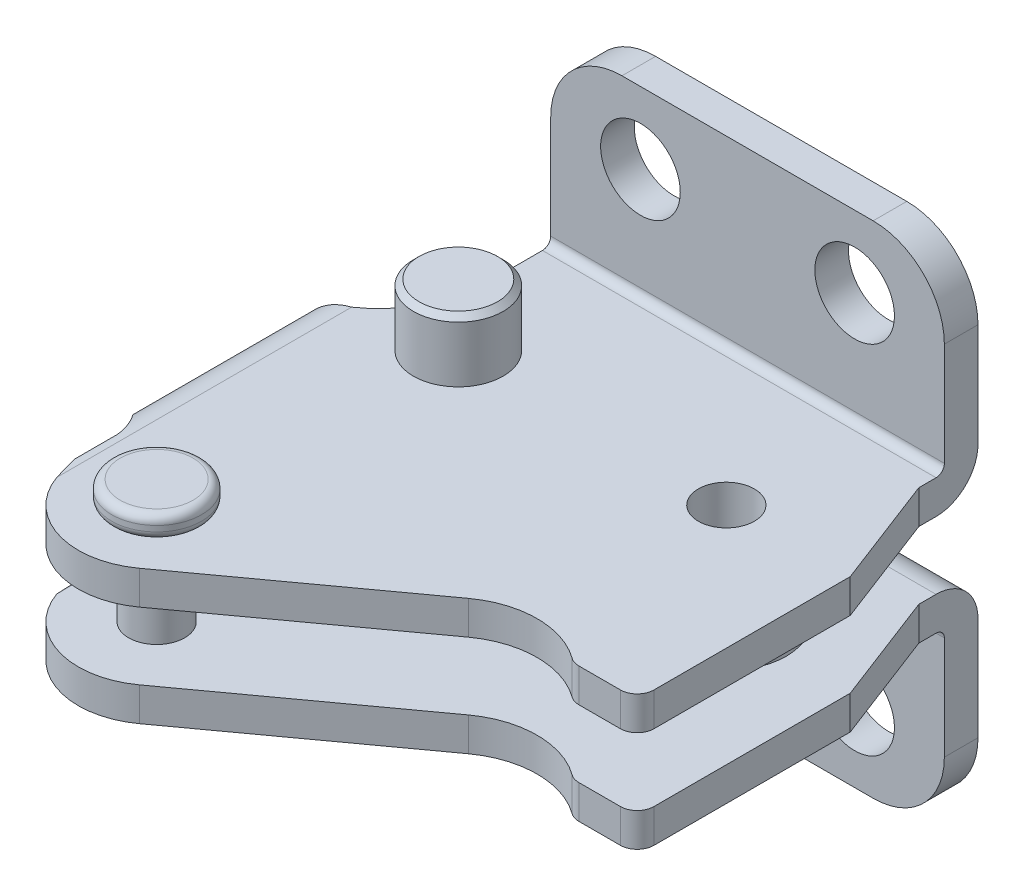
ISO-10303-21;
HEADER;
FILE_DESCRIPTION(('STEP AP214'),'2;1');
FILE_NAME('part.step','',(''),(''),'','','');
FILE_SCHEMA(('AUTOMOTIVE_DESIGN { 1 0 10303 214 1 1 1 1 }'));
ENDSEC;
DATA;
#1=APPLICATION_CONTEXT('core data for automotive mechanical design processes');
#2=APPLICATION_PROTOCOL_DEFINITION('international standard','automotive_design',2000,#1);
#3=PRODUCT_CONTEXT('',#1,'mechanical');
#4=PRODUCT('Part','Part','',(#3));
#5=PRODUCT_RELATED_PRODUCT_CATEGORY('part','',(#4));
#6=PRODUCT_DEFINITION_FORMATION('','',#4);
#7=PRODUCT_DEFINITION_CONTEXT('part definition',#1,'design');
#8=PRODUCT_DEFINITION('design','',#6,#7);
#9=PRODUCT_DEFINITION_SHAPE('','',#8);
#10=(LENGTH_UNIT() NAMED_UNIT(*) SI_UNIT(.MILLI.,.METRE.));
#11=(NAMED_UNIT(*) PLANE_ANGLE_UNIT() SI_UNIT($,.RADIAN.));
#12=(NAMED_UNIT(*) SI_UNIT($,.STERADIAN.) SOLID_ANGLE_UNIT());
#13=UNCERTAINTY_MEASURE_WITH_UNIT(LENGTH_MEASURE(1.E-05),#10,'distance_accuracy_value','');
#14=(GEOMETRIC_REPRESENTATION_CONTEXT(3) GLOBAL_UNCERTAINTY_ASSIGNED_CONTEXT((#13)) GLOBAL_UNIT_ASSIGNED_CONTEXT((#10,
#11,#12)) REPRESENTATION_CONTEXT('',''));
#15=CARTESIAN_POINT('',(0.,0.,0.));
#16=DIRECTION('',(0.,0.,1.));
#17=DIRECTION('',(1.,0.,0.));
#18=AXIS2_PLACEMENT_3D('',#15,#16,#17);
#19=CARTESIAN_POINT('',(19.8610000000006,21.8957081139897,15.2016081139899));
#20=DIRECTION('',(0.,-1.,0.));
#21=DIRECTION('',(0.900994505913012,0.,0.433830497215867));
#22=AXIS2_PLACEMENT_3D('',#19,#20,#21);
#23=CYLINDRICAL_SURFACE('',#22,2.5);
#24=CARTESIAN_POINT('',(19.8610000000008,9.89570811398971,15.20160811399));
#25=DIRECTION('',(0.,1.,0.));
#26=DIRECTION('',(-0.900994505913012,0.,-0.433830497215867));
#27=AXIS2_PLACEMENT_3D('',#24,#25,#26);
#28=CIRCLE('',#27,2.5);
#29=CARTESIAN_POINT('',(17.6085137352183,9.89570811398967,14.1170318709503));
#30=VERTEX_POINT('',#29);
#31=EDGE_CURVE('E2420',#30,#30,#28,.T.);
#32=ORIENTED_EDGE('',*,*,#31,.F.);
#33=EDGE_LOOP('',(#32));
#34=FACE_BOUND('',#33,.T.);
#35=CARTESIAN_POINT('',(19.8610000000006,21.9001154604,15.2016081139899));
#36=DIRECTION('',(0.,-1.,0.));
#37=DIRECTION('',(1.,0.,0.));
#38=AXIS2_PLACEMENT_3D('',#35,#36,#37);
#39=CIRCLE('',#38,2.5);
#40=CARTESIAN_POINT('',(22.3610000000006,21.9001154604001,15.2016081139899));
#41=VERTEX_POINT('',#40);
#42=EDGE_CURVE('E486',#41,#41,#39,.F.);
#43=ORIENTED_EDGE('',*,*,#42,.T.);
#44=EDGE_LOOP('',(#43));
#45=FACE_BOUND('',#44,.T.);
#46=ADVANCED_FACE('F14',(#34,#45),#23,.F.);
#47=CARTESIAN_POINT('',(19.8610000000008,9.89570811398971,15.20160811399));
#48=DIRECTION('',(0.,1.,0.));
#49=DIRECTION('',(-0.900994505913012,0.,-0.433830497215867));
#50=AXIS2_PLACEMENT_3D('',#47,#48,#49);
#51=PLANE('',#50);
#52=CARTESIAN_POINT('',(-4.04059780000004,9.89570811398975,15.2016486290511));
#53=DIRECTION('',(0.,1.,0.));
#54=DIRECTION('',(-1.,0.,0.));
#55=AXIS2_PLACEMENT_3D('',#52,#53,#54);
#56=CIRCLE('',#55,3.1);
#57=CARTESIAN_POINT('',(-7.14059780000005,9.89570811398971,15.2016486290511));
#58=VERTEX_POINT('',#57);
#59=EDGE_CURVE('E1522',#58,#58,#56,.F.);
#60=ORIENTED_EDGE('',*,*,#59,.F.);
#61=EDGE_LOOP('',(#60));
#62=FACE_BOUND('',#61,.T.);
#63=DIRECTION('',(0.,0.,1.));
#64=VECTOR('',#63,1.);
#65=CARTESIAN_POINT('',(-8.00000000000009,9.89570811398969,8.78584225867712));
#66=LINE('',#65,#64);
#67=CARTESIAN_POINT('',(-8.00000000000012,9.89570811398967,3.74));
#68=VERTEX_POINT('',#67);
#69=CARTESIAN_POINT('',(-8.00000000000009,9.89570811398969,8.78584225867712));
#70=VERTEX_POINT('',#69);
#71=EDGE_CURVE('E1048',#68,#70,#66,.T.);
#72=ORIENTED_EDGE('',*,*,#71,.F.);
#73=DIRECTION('',(1.,0.,0.));
#74=VECTOR('',#73,1.);
#75=CARTESIAN_POINT('',(-56.2980156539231,9.89570811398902,3.74000000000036));
#76=LINE('',#75,#74);
#77=CARTESIAN_POINT('',(27.1,9.89570811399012,3.73999999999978));
#78=VERTEX_POINT('',#77);
#79=EDGE_CURVE('E1211',#68,#78,#76,.T.);
#80=ORIENTED_EDGE('',*,*,#79,.T.);
#81=DIRECTION('',(0.,0.,-1.));
#82=VECTOR('',#81,1.);
#83=CARTESIAN_POINT('',(27.1,9.89570811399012,5.27625929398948));
#84=LINE('',#83,#82);
#85=CARTESIAN_POINT('',(27.1,9.89570811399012,5.27625929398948));
#86=VERTEX_POINT('',#85);
#87=EDGE_CURVE('E1047',#86,#78,#84,.T.);
#88=ORIENTED_EDGE('',*,*,#87,.F.);
#89=DIRECTION('',(-0.358367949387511,0.,-0.933580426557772));
#90=VECTOR('',#89,1.);
#91=CARTESIAN_POINT('',(30.9100000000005,9.89570811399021,15.2016486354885));
#92=LINE('',#91,#90);
#93=CARTESIAN_POINT('',(30.9100000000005,9.89570811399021,15.2016486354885));
#94=VERTEX_POINT('',#93);
#95=EDGE_CURVE('E1229',#94,#86,#92,.T.);
#96=ORIENTED_EDGE('',*,*,#95,.F.);
#97=DIRECTION('',(0.,0.,-1.));
#98=VECTOR('',#97,1.);
#99=CARTESIAN_POINT('',(30.9100000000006,9.89570811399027,32.6996486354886));
#100=LINE('',#99,#98);
#101=CARTESIAN_POINT('',(30.9100000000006,9.89570811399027,32.6996486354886));
#102=VERTEX_POINT('',#101);
#103=EDGE_CURVE('E1174',#102,#94,#100,.T.);
#104=ORIENTED_EDGE('',*,*,#103,.F.);
#105=CARTESIAN_POINT('',(29.4100000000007,9.89570811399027,32.6996486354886));
#106=DIRECTION('',(0.,1.,0.));
#107=DIRECTION('',(-1.,0.,0.));
#108=AXIS2_PLACEMENT_3D('',#105,#106,#107);
#109=CIRCLE('',#108,1.49999999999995);
#110=CARTESIAN_POINT('',(29.4100000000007,9.89570811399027,34.1996486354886));
#111=VERTEX_POINT('',#110);
#112=EDGE_CURVE('E1053',#111,#102,#109,.T.);
#113=ORIENTED_EDGE('',*,*,#112,.F.);
#114=DIRECTION('',(1.,0.,0.));
#115=VECTOR('',#114,1.);
#116=CARTESIAN_POINT('',(29.4100000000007,9.89570811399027,34.1996486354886));
#117=LINE('',#116,#115);
#118=CARTESIAN_POINT('',(25.7069358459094,9.89570811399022,34.1996486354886));
#119=VERTEX_POINT('',#118);
#120=EDGE_CURVE('E1054',#119,#111,#117,.T.);
#121=ORIENTED_EDGE('',*,*,#120,.F.);
#122=CARTESIAN_POINT('',(25.7069358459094,9.89570811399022,32.6996486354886));
#123=DIRECTION('',(0.,1.,0.));
#124=DIRECTION('',(-1.,0.,0.));
#125=AXIS2_PLACEMENT_3D('',#122,#123,#124);
#126=CIRCLE('',#125,1.49999999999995);
#127=CARTESIAN_POINT('',(24.8237924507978,9.89570811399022,33.9121080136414));
#128=VERTEX_POINT('',#127);
#129=EDGE_CURVE('E1134',#128,#119,#126,.T.);
#130=ORIENTED_EDGE('',*,*,#129,.F.);
#131=CARTESIAN_POINT('',(20.1878783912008,9.89570811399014,40.2767114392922));
#132=DIRECTION('',(0.,-1.,0.));
#133=DIRECTION('',(-1.,0.,0.));
#134=AXIS2_PLACEMENT_3D('',#131,#132,#133);
#135=CIRCLE('',#134,7.8739999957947);
#136=CARTESIAN_POINT('',(15.5596573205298,9.89570811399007,33.9065116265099));
#137=VERTEX_POINT('',#136);
#138=EDGE_CURVE('E1075',#137,#128,#135,.T.);
#139=ORIENTED_EDGE('',*,*,#138,.F.);
#140=DIRECTION('',(0.809016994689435,0.,-0.587785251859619));
#141=VECTOR('',#140,1.);
#142=CARTESIAN_POINT('',(-1.43332002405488,9.89570811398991,46.2526323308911));
#143=LINE('',#142,#141);
#144=CARTESIAN_POINT('',(-1.43332002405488,9.89570811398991,46.2526323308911));
#145=VERTEX_POINT('',#144);
#146=EDGE_CURVE('E455',#145,#137,#143,.T.);
#147=ORIENTED_EDGE('',*,*,#146,.F.);
#148=CARTESIAN_POINT('',(-5.53900000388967,9.8957081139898,40.6016486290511));
#149=DIRECTION('',(0.,1.,0.));
#150=DIRECTION('',(-1.,0.,0.));
#151=AXIS2_PLACEMENT_3D('',#148,#149,#150);
#152=CIRCLE('',#151,6.98499999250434);
#153=CARTESIAN_POINT('',(-12.130211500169,9.89570811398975,42.9138242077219));
#154=VERTEX_POINT('',#153);
#155=EDGE_CURVE('E464',#154,#145,#152,.T.);
#156=ORIENTED_EDGE('',*,*,#155,.F.);
#157=DIRECTION('',(0.,0.,1.));
#158=VECTOR('',#157,1.);
#159=CARTESIAN_POINT('',(-12.1302115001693,9.89570811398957,-8.98429188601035));
#160=LINE('',#159,#158);
#161=CARTESIAN_POINT('',(-12.1302115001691,9.89570811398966,16.6226382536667));
#162=VERTEX_POINT('',#161);
#163=EDGE_CURVE('E1232',#162,#154,#160,.T.);
#164=ORIENTED_EDGE('',*,*,#163,.F.);
#165=CARTESIAN_POINT('',(-17.5,9.89570811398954,8.78584225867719));
#166=DIRECTION('',(0.,-1.,0.));
#167=DIRECTION('',(-1.,0.,0.));
#168=AXIS2_PLACEMENT_3D('',#165,#166,#167);
#169=CIRCLE('',#168,9.5);
#170=EDGE_CURVE('E465',#70,#162,#169,.T.);
#171=ORIENTED_EDGE('',*,*,#170,.F.);
#172=EDGE_LOOP('',(#72,#80,#88,#96,#104,#113,#121,#130,#139,#147,#156,#164,#171));
#173=FACE_BOUND('',#172,.T.);
#174=CARTESIAN_POINT('',(-5.53900000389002,9.89570811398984,40.6016486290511));
#175=DIRECTION('',(0.,1.,0.));
#176=DIRECTION('',(-1.,0.,0.));
#177=AXIS2_PLACEMENT_3D('',#174,#175,#176);
#178=CIRCLE('',#177,2.5);
#179=CARTESIAN_POINT('',(-8.03900000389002,9.89570811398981,40.6016486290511));
#180=VERTEX_POINT('',#179);
#181=EDGE_CURVE('E2417',#180,#180,#178,.F.);
#182=ORIENTED_EDGE('',*,*,#181,.F.);
#183=EDGE_LOOP('',(#182));
#184=FACE_BOUND('',#183,.T.);
#185=ORIENTED_EDGE('',*,*,#31,.T.);
#186=EDGE_LOOP('',(#185));
#187=FACE_BOUND('',#186,.T.);
#188=ADVANCED_FACE('F1368',(#62,#173,#184,#187),#51,.F.);
#189=CARTESIAN_POINT('',(-5.53900000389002,7.8601154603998,40.6016486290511));
#190=DIRECTION('',(0.,1.,0.));
#191=DIRECTION('',(-1.,0.,0.));
#192=AXIS2_PLACEMENT_3D('',#189,#190,#191);
#193=PLANE('',#192);
#194=CARTESIAN_POINT('',(-5.53900000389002,7.8601154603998,40.6016486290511));
#195=DIRECTION('',(0.,-1.,0.));
#196=DIRECTION('',(-1.,0.,0.));
#197=AXIS2_PLACEMENT_3D('',#194,#195,#196);
#198=CIRCLE('',#197,3.25);
#199=CARTESIAN_POINT('',(-8.78900000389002,7.8601154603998,40.6016486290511));
#200=VERTEX_POINT('',#199);
#201=EDGE_CURVE('E2377',#200,#200,#198,.T.);
#202=ORIENTED_EDGE('',*,*,#201,.T.);
#203=EDGE_LOOP('',(#202));
#204=FACE_BOUND('',#203,.T.);
#205=ADVANCED_FACE('F1371',(#204),#193,.F.);
#206=CARTESIAN_POINT('',(-5.53900000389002,8.6101154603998,40.6016486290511));
#207=DIRECTION('',(0.,1.,0.));
#208=DIRECTION('',(-1.,0.,0.));
#209=AXIS2_PLACEMENT_3D('',#206,#207,#208);
#210=TOROIDAL_SURFACE('',#209,3.25,0.75);
#211=CARTESIAN_POINT('',(-5.53900000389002,8.6101154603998,40.6016486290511));
#212=DIRECTION('',(0.,1.,0.));
#213=DIRECTION('',(-1.,0.,0.));
#214=AXIS2_PLACEMENT_3D('',#211,#212,#213);
#215=CIRCLE('',#214,4.);
#216=CARTESIAN_POINT('',(-9.53900000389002,8.6101154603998,40.6016486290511));
#217=VERTEX_POINT('',#216);
#218=EDGE_CURVE('E2362',#217,#217,#215,.T.);
#219=ORIENTED_EDGE('',*,*,#218,.F.);
#220=EDGE_LOOP('',(#219));
#221=FACE_BOUND('',#220,.T.);
#222=ORIENTED_EDGE('',*,*,#201,.F.);
#223=EDGE_LOOP('',(#222));
#224=FACE_BOUND('',#223,.T.);
#225=ADVANCED_FACE('F1384',(#221,#224),#210,.T.);
#226=CARTESIAN_POINT('',(-4.0405978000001,13.2001154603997,15.2016486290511));
#227=DIRECTION('',(0.,-1.,0.));
#228=DIRECTION('',(0.923728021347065,0.,-0.383049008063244));
#229=AXIS2_PLACEMENT_3D('',#226,#227,#228);
#230=CONICAL_SURFACE('',#229,1.9,1.02974425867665);
#231=CARTESIAN_POINT('',(-4.0405978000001,13.2001154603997,15.2016486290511));
#232=DIRECTION('',(0.,-1.,0.));
#233=DIRECTION('',(0.923728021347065,0.,-0.383049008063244));
#234=AXIS2_PLACEMENT_3D('',#231,#232,#233);
#235=CIRCLE('',#234,1.9);
#236=CARTESIAN_POINT('',(-2.28551455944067,13.2001154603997,14.4738555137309));
#237=VERTEX_POINT('',#236);
#238=EDGE_CURVE('E2390',#237,#237,#235,.T.);
#239=ORIENTED_EDGE('',*,*,#238,.T.);
#240=EDGE_LOOP('',(#239));
#241=FACE_BOUND('',#240,.T.);
#242=CARTESIAN_POINT('',(-4.0405978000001,14.3417506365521,15.2016486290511));
#243=VERTEX_POINT('',#242);
#244=VERTEX_LOOP('',#243);
#245=FACE_BOUND('',#244,.T.);
#246=ADVANCED_FACE('F1391',(#241,#245),#230,.F.);
#247=CARTESIAN_POINT('',(-5.53900000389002,23.9001154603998,40.601648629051));
#248=DIRECTION('',(0.,1.,0.));
#249=DIRECTION('',(-1.,0.,0.));
#250=AXIS2_PLACEMENT_3D('',#247,#248,#249);
#251=PLANE('',#250);
#252=CARTESIAN_POINT('',(-5.53900000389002,23.9001154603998,40.601648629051));
#253=DIRECTION('',(0.,1.,0.));
#254=DIRECTION('',(-1.,0.,0.));
#255=AXIS2_PLACEMENT_3D('',#252,#253,#254);
#256=CIRCLE('',#255,3.25);
#257=CARTESIAN_POINT('',(-8.78900000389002,23.9001154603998,40.6016486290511));
#258=VERTEX_POINT('',#257);
#259=EDGE_CURVE('E1524',#258,#258,#256,.T.);
#260=ORIENTED_EDGE('',*,*,#259,.T.);
#261=EDGE_LOOP('',(#260));
#262=FACE_BOUND('',#261,.T.);
#263=ADVANCED_FACE('F1414',(#262),#251,.T.);
#264=CARTESIAN_POINT('',(-5.53900000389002,9.8601154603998,40.6016486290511));
#265=DIRECTION('',(0.,-1.,0.));
#266=DIRECTION('',(1.,0.,0.));
#267=AXIS2_PLACEMENT_3D('',#264,#265,#266);
#268=CYLINDRICAL_SURFACE('',#267,4.);
#269=ORIENTED_EDGE('',*,*,#218,.T.);
#270=EDGE_LOOP('',(#269));
#271=FACE_BOUND('',#270,.T.);
#272=CARTESIAN_POINT('',(-5.53900000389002,9.1101154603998,40.6016486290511));
#273=DIRECTION('',(0.,-1.,0.));
#274=DIRECTION('',(-1.,0.,0.));
#275=AXIS2_PLACEMENT_3D('',#272,#273,#274);
#276=CIRCLE('',#275,4.);
#277=CARTESIAN_POINT('',(-9.53900000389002,9.1101154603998,40.6016486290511));
#278=VERTEX_POINT('',#277);
#279=EDGE_CURVE('E2357',#278,#278,#276,.T.);
#280=ORIENTED_EDGE('',*,*,#279,.T.);
#281=EDGE_LOOP('',(#280));
#282=FACE_BOUND('',#281,.T.);
#283=ADVANCED_FACE('F1417',(#271,#282),#268,.T.);
#284=CARTESIAN_POINT('',(-4.04059780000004,9.20011546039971,15.2016486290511));
#285=DIRECTION('',(0.,-1.,0.));
#286=DIRECTION('',(0.923728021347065,0.,-0.383049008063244));
#287=AXIS2_PLACEMENT_3D('',#284,#285,#286);
#288=CYLINDRICAL_SURFACE('',#287,1.9);
#289=CARTESIAN_POINT('',(-4.04059780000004,9.80011546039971,15.2016486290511));
#290=DIRECTION('',(0.,-1.,0.));
#291=DIRECTION('',(0.923728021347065,0.,-0.383049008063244));
#292=AXIS2_PLACEMENT_3D('',#289,#290,#291);
#293=CIRCLE('',#292,1.9);
#294=CARTESIAN_POINT('',(-2.28551455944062,9.80011546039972,14.4738555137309));
#295=VERTEX_POINT('',#294);
#296=EDGE_CURVE('E1536',#295,#295,#293,.T.);
#297=ORIENTED_EDGE('',*,*,#296,.T.);
#298=EDGE_LOOP('',(#297));
#299=FACE_BOUND('',#298,.T.);
#300=ORIENTED_EDGE('',*,*,#238,.F.);
#301=EDGE_LOOP('',(#300));
#302=FACE_BOUND('',#301,.T.);
#303=ADVANCED_FACE('F1421',(#299,#302),#288,.F.);
#304=CARTESIAN_POINT('',(-5.53900000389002,23.1501154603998,40.601648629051));
#305=DIRECTION('',(0.,1.,0.));
#306=DIRECTION('',(-1.,0.,0.));
#307=AXIS2_PLACEMENT_3D('',#304,#305,#306);
#308=TOROIDAL_SURFACE('',#307,3.25,0.75);
#309=ORIENTED_EDGE('',*,*,#259,.F.);
#310=EDGE_LOOP('',(#309));
#311=FACE_BOUND('',#310,.T.);
#312=CARTESIAN_POINT('',(-5.53900000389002,23.1501154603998,40.601648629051));
#313=DIRECTION('',(0.,-1.,0.));
#314=DIRECTION('',(-1.,0.,0.));
#315=AXIS2_PLACEMENT_3D('',#312,#313,#314);
#316=CIRCLE('',#315,4.);
#317=CARTESIAN_POINT('',(-9.53900000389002,23.1501154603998,40.6016486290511));
#318=VERTEX_POINT('',#317);
#319=EDGE_CURVE('E2352',#318,#318,#316,.T.);
#320=ORIENTED_EDGE('',*,*,#319,.F.);
#321=EDGE_LOOP('',(#320));
#322=FACE_BOUND('',#321,.T.);
#323=ADVANCED_FACE('F1425',(#311,#322),#308,.T.);
#324=CARTESIAN_POINT('',(-4.04059780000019,27.4001154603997,15.201648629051));
#325=DIRECTION('',(0.,-1.,0.));
#326=DIRECTION('',(0.923728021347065,0.,-0.383049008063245));
#327=AXIS2_PLACEMENT_3D('',#324,#325,#326);
#328=PLANE('',#327);
#329=CARTESIAN_POINT('',(-4.04059780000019,27.4001154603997,15.201648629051));
#330=DIRECTION('',(0.,1.,0.));
#331=DIRECTION('',(0.923728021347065,0.,-0.383049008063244));
#332=AXIS2_PLACEMENT_3D('',#329,#330,#331);
#333=CIRCLE('',#332,3.5);
#334=CARTESIAN_POINT('',(-0.807549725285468,27.4001154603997,13.8609771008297));
#335=VERTEX_POINT('',#334);
#336=EDGE_CURVE('E1155',#335,#335,#333,.T.);
#337=ORIENTED_EDGE('',*,*,#336,.T.);
#338=EDGE_LOOP('',(#337));
#339=FACE_BOUND('',#338,.T.);
#340=ADVANCED_FACE('F1436',(#339),#328,.F.);
#341=CARTESIAN_POINT('',(-3.22658566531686E-13,31.7958235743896,-9.00440734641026));
#342=DIRECTION('',(0.,0.,-1.));
#343=DIRECTION('',(1.,0.,0.));
#344=AXIS2_PLACEMENT_3D('',#341,#342,#343);
#345=CYLINDRICAL_SURFACE('',#344,3.55);
#346=CARTESIAN_POINT('',(-3.00107161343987E-13,31.7958235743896,0.));
#347=DIRECTION('',(0.,0.,-1.));
#348=DIRECTION('',(1.,0.,0.));
#349=AXIS2_PLACEMENT_3D('',#346,#347,#348);
#350=CIRCLE('',#349,3.55);
#351=CARTESIAN_POINT('',(3.5499999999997,31.7958235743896,-1.14838694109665E-13));
#352=VERTEX_POINT('',#351);
#353=EDGE_CURVE('E1156',#352,#352,#350,.T.);
#354=ORIENTED_EDGE('',*,*,#353,.T.);
#355=EDGE_LOOP('',(#354));
#356=FACE_BOUND('',#355,.T.);
#357=CARTESIAN_POINT('',(-3.40005801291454E-13,31.7958235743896,2.99999999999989));
#358=DIRECTION('',(0.,0.,-1.));
#359=DIRECTION('',(1.,0.,0.));
#360=AXIS2_PLACEMENT_3D('',#357,#358,#359);
#361=CIRCLE('',#360,3.55);
#362=CARTESIAN_POINT('',(3.54999999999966,31.7958235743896,2.99999999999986));
#363=VERTEX_POINT('',#362);
#364=EDGE_CURVE('E1011',#363,#363,#361,.T.);
#365=ORIENTED_EDGE('',*,*,#364,.F.);
#366=EDGE_LOOP('',(#365));
#367=FACE_BOUND('',#366,.T.);
#368=ADVANCED_FACE('F764',(#356,#367),#345,.F.);
#369=CARTESIAN_POINT('',(19.0999999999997,31.7958235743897,-9.00440734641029));
#370=DIRECTION('',(0.,0.,-1.));
#371=DIRECTION('',(1.,0.,0.));
#372=AXIS2_PLACEMENT_3D('',#369,#370,#371);
#373=CYLINDRICAL_SURFACE('',#372,3.55);
#374=CARTESIAN_POINT('',(19.0999999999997,31.7958235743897,-2.4459601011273E-13));
#375=DIRECTION('',(0.,0.,-1.));
#376=DIRECTION('',(1.,0.,0.));
#377=AXIS2_PLACEMENT_3D('',#374,#375,#376);
#378=CIRCLE('',#377,3.55);
#379=CARTESIAN_POINT('',(22.6499999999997,31.7958235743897,-2.69229083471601E-13));
#380=VERTEX_POINT('',#379);
#381=EDGE_CURVE('E1151',#380,#380,#378,.T.);
#382=ORIENTED_EDGE('',*,*,#381,.T.);
#383=EDGE_LOOP('',(#382));
#384=FACE_BOUND('',#383,.T.);
#385=CARTESIAN_POINT('',(19.0999999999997,31.7958235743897,2.99999999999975));
#386=DIRECTION('',(0.,0.,-1.));
#387=DIRECTION('',(1.,0.,0.));
#388=AXIS2_PLACEMENT_3D('',#385,#386,#387);
#389=CIRCLE('',#388,3.55);
#390=CARTESIAN_POINT('',(22.6499999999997,31.7958235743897,2.99999999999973));
#391=VERTEX_POINT('',#390);
#392=EDGE_CURVE('E1055',#391,#391,#389,.T.);
#393=ORIENTED_EDGE('',*,*,#392,.F.);
#394=EDGE_LOOP('',(#393));
#395=FACE_BOUND('',#394,.T.);
#396=ADVANCED_FACE('F760',(#384,#395),#373,.F.);
#397=CARTESIAN_POINT('',(27.0999999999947,17.5852723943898,-2.89698820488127E-13));
#398=DIRECTION('',(-1.,0.,0.));
#399=DIRECTION('',(0.,0.,-1.));
#400=AXIS2_PLACEMENT_3D('',#397,#398,#399);
#401=PLANE('',#400);
#402=DIRECTION('',(0.,-1.,0.));
#403=VECTOR('',#402,1.);
#404=CARTESIAN_POINT('',(27.0999999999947,17.5852723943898,2.9999999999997));
#405=LINE('',#404,#403);
#406=CARTESIAN_POINT('',(27.0999999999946,31.8458235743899,2.9999999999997));
#407=VERTEX_POINT('',#406);
#408=CARTESIAN_POINT('',(27.0999999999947,22.6401154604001,2.99999999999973));
#409=VERTEX_POINT('',#408);
#410=EDGE_CURVE('E485',#407,#409,#405,.T.);
#411=ORIENTED_EDGE('',*,*,#410,.T.);
#412=CARTESIAN_POINT('',(27.0999999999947,22.6401154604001,3.73999999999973));
#413=DIRECTION('',(-1.,0.,0.));
#414=DIRECTION('',(0.,1.,0.));
#415=AXIS2_PLACEMENT_3D('',#412,#413,#414);
#416=CIRCLE('',#415,0.74);
#417=CARTESIAN_POINT('',(27.0999999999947,21.9001154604,3.73999999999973));
#418=VERTEX_POINT('',#417);
#419=EDGE_CURVE('E450',#409,#418,#416,.T.);
#420=ORIENTED_EDGE('',*,*,#419,.T.);
#421=DIRECTION('',(0.,0.,1.));
#422=VECTOR('',#421,1.);
#423=CARTESIAN_POINT('',(27.0999999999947,21.9001154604,5.27625929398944));
#424=LINE('',#423,#422);
#425=CARTESIAN_POINT('',(27.0999999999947,21.9001154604,5.27625929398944));
#426=VERTEX_POINT('',#425);
#427=EDGE_CURVE('E1202',#418,#426,#424,.T.);
#428=ORIENTED_EDGE('',*,*,#427,.T.);
#429=DIRECTION('',(0.,1.,0.));
#430=VECTOR('',#429,1.);
#431=CARTESIAN_POINT('',(27.0999999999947,18.9001154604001,5.27625929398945));
#432=LINE('',#431,#430);
#433=CARTESIAN_POINT('',(27.0999999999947,18.9001154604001,5.27625929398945));
#434=VERTEX_POINT('',#433);
#435=EDGE_CURVE('E1017',#434,#426,#432,.T.);
#436=ORIENTED_EDGE('',*,*,#435,.F.);
#437=DIRECTION('',(0.,0.,1.));
#438=VECTOR('',#437,1.);
#439=CARTESIAN_POINT('',(27.0999999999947,18.9001154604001,5.27625929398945));
#440=LINE('',#439,#438);
#441=CARTESIAN_POINT('',(27.0999999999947,18.9001154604,3.73999999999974));
#442=VERTEX_POINT('',#441);
#443=EDGE_CURVE('E1092',#442,#434,#440,.T.);
#444=ORIENTED_EDGE('',*,*,#443,.F.);
#445=CARTESIAN_POINT('',(27.0999999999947,22.6401154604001,3.73999999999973));
#446=DIRECTION('',(-1.,0.,0.));
#447=DIRECTION('',(0.,-1.,0.));
#448=AXIS2_PLACEMENT_3D('',#445,#446,#447);
#449=CIRCLE('',#448,3.74);
#450=CARTESIAN_POINT('',(27.0999999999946,22.6401154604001,-2.86229373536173E-13));
#451=VERTEX_POINT('',#450);
#452=EDGE_CURVE('E1124',#451,#442,#449,.T.);
#453=ORIENTED_EDGE('',*,*,#452,.F.);
#454=DIRECTION('',(0.,-1.,0.));
#455=VECTOR('',#454,1.);
#456=CARTESIAN_POINT('',(27.0999999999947,17.5852723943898,-2.89698820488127E-13));
#457=LINE('',#456,#455);
#458=CARTESIAN_POINT('',(27.0999999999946,31.8458235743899,-2.79290479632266E-13));
#459=VERTEX_POINT('',#458);
#460=EDGE_CURVE('E1287',#459,#451,#457,.T.);
#461=ORIENTED_EDGE('',*,*,#460,.F.);
#462=DIRECTION('',(0.,0.,1.));
#463=VECTOR('',#462,1.);
#464=CARTESIAN_POINT('',(27.0999999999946,31.8458235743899,-2.79290479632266E-13));
#465=LINE('',#464,#463);
#466=EDGE_CURVE('E483',#459,#407,#465,.T.);
#467=ORIENTED_EDGE('',*,*,#466,.T.);
#468=EDGE_LOOP('',(#411,#420,#428,#436,#444,#453,#461,#467));
#469=FACE_BOUND('',#468,.T.);
#470=ADVANCED_FACE('F763',(#469),#401,.F.);
#471=CARTESIAN_POINT('',(20.7499999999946,31.8458235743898,-2.34187669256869E-13));
#472=DIRECTION('',(0.,0.,1.));
#473=DIRECTION('',(-1.,0.,0.));
#474=AXIS2_PLACEMENT_3D('',#471,#472,#473);
#475=CYLINDRICAL_SURFACE('',#474,6.35);
#476=CARTESIAN_POINT('',(20.7499999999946,31.8458235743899,2.99999999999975));
#477=DIRECTION('',(0.,0.,-1.));
#478=DIRECTION('',(1.,0.,0.));
#479=AXIS2_PLACEMENT_3D('',#476,#477,#478);
#480=CIRCLE('',#479,6.35);
#481=CARTESIAN_POINT('',(20.7499999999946,38.1958235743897,2.99999999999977));
#482=VERTEX_POINT('',#481);
#483=EDGE_CURVE('E1244',#482,#407,#480,.T.);
#484=ORIENTED_EDGE('',*,*,#483,.T.);
#485=ORIENTED_EDGE('',*,*,#466,.F.);
#486=CARTESIAN_POINT('',(20.7499999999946,31.8458235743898,-2.34187669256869E-13));
#487=DIRECTION('',(0.,0.,-1.));
#488=DIRECTION('',(1.,0.,0.));
#489=AXIS2_PLACEMENT_3D('',#486,#487,#488);
#490=CIRCLE('',#489,6.35);
#491=CARTESIAN_POINT('',(20.7499999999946,38.1958235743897,-2.34187669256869E-13));
#492=VERTEX_POINT('',#491);
#493=EDGE_CURVE('E1291',#492,#459,#490,.T.);
#494=ORIENTED_EDGE('',*,*,#493,.F.);
#495=DIRECTION('',(0.,0.,1.));
#496=VECTOR('',#495,1.);
#497=CARTESIAN_POINT('',(20.7499999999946,38.1958235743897,-2.34187669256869E-13));
#498=LINE('',#497,#496);
#499=EDGE_CURVE('E1149',#492,#482,#498,.T.);
#500=ORIENTED_EDGE('',*,*,#499,.T.);
#501=EDGE_LOOP('',(#484,#485,#494,#500));
#502=FACE_BOUND('',#501,.T.);
#503=ADVANCED_FACE('F739',(#502),#475,.T.);
#504=CARTESIAN_POINT('',(-1.65000000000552,38.1958235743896,0.));
#505=DIRECTION('',(0.,-1.,0.));
#506=DIRECTION('',(0.,0.,1.));
#507=AXIS2_PLACEMENT_3D('',#504,#505,#506);
#508=PLANE('',#507);
#509=DIRECTION('',(1.,0.,0.));
#510=VECTOR('',#509,1.);
#511=CARTESIAN_POINT('',(-1.6500000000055,38.1958235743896,2.99999999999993));
#512=LINE('',#511,#510);
#513=CARTESIAN_POINT('',(-1.6500000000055,38.1958235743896,2.99999999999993));
#514=VERTEX_POINT('',#513);
#515=EDGE_CURVE('E1145',#514,#482,#512,.T.);
#516=ORIENTED_EDGE('',*,*,#515,.T.);
#517=ORIENTED_EDGE('',*,*,#499,.F.);
#518=DIRECTION('',(1.,0.,0.));
#519=VECTOR('',#518,1.);
#520=CARTESIAN_POINT('',(-1.65000000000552,38.1958235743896,0.));
#521=LINE('',#520,#519);
#522=CARTESIAN_POINT('',(-1.65000000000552,38.1958235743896,0.));
#523=VERTEX_POINT('',#522);
#524=EDGE_CURVE('E1120',#523,#492,#521,.T.);
#525=ORIENTED_EDGE('',*,*,#524,.F.);
#526=DIRECTION('',(0.,0.,1.));
#527=VECTOR('',#526,1.);
#528=CARTESIAN_POINT('',(-1.65000000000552,38.1958235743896,0.));
#529=LINE('',#528,#527);
#530=EDGE_CURVE('E1150',#523,#514,#529,.T.);
#531=ORIENTED_EDGE('',*,*,#530,.T.);
#532=EDGE_LOOP('',(#516,#517,#525,#531));
#533=FACE_BOUND('',#532,.T.);
#534=ADVANCED_FACE('F735',(#533),#508,.F.);
#535=CARTESIAN_POINT('',(-1.6500000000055,31.8458235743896,0.));
#536=DIRECTION('',(0.,0.,1.));
#537=DIRECTION('',(-1.,0.,0.));
#538=AXIS2_PLACEMENT_3D('',#535,#536,#537);
#539=CYLINDRICAL_SURFACE('',#538,6.35);
#540=CARTESIAN_POINT('',(-1.65000000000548,31.8458235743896,2.9999999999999));
#541=DIRECTION('',(0.,0.,-1.));
#542=DIRECTION('',(1.,0.,0.));
#543=AXIS2_PLACEMENT_3D('',#540,#541,#542);
#544=CIRCLE('',#543,6.35);
#545=CARTESIAN_POINT('',(-8.00000000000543,31.8458235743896,2.99999999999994));
#546=VERTEX_POINT('',#545);
#547=EDGE_CURVE('E480',#546,#514,#544,.T.);
#548=ORIENTED_EDGE('',*,*,#547,.T.);
#549=ORIENTED_EDGE('',*,*,#530,.F.);
#550=CARTESIAN_POINT('',(-1.6500000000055,31.8458235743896,0.));
#551=DIRECTION('',(0.,0.,-1.));
#552=DIRECTION('',(1.,0.,0.));
#553=AXIS2_PLACEMENT_3D('',#550,#551,#552);
#554=CIRCLE('',#553,6.35);
#555=CARTESIAN_POINT('',(-8.00000000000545,31.8458235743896,0.));
#556=VERTEX_POINT('',#555);
#557=EDGE_CURVE('E1116',#556,#523,#554,.T.);
#558=ORIENTED_EDGE('',*,*,#557,.F.);
#559=DIRECTION('',(0.,0.,1.));
#560=VECTOR('',#559,1.);
#561=CARTESIAN_POINT('',(-8.00000000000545,31.8458235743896,0.));
#562=LINE('',#561,#560);
#563=EDGE_CURVE('E478',#556,#546,#562,.T.);
#564=ORIENTED_EDGE('',*,*,#563,.T.);
#565=EDGE_LOOP('',(#548,#549,#558,#564));
#566=FACE_BOUND('',#565,.T.);
#567=ADVANCED_FACE('F738',(#566),#539,.T.);
#568=CARTESIAN_POINT('',(-8.0000000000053,14.0756894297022,0.));
#569=DIRECTION('',(1.,0.,0.));
#570=DIRECTION('',(0.,1.,0.));
#571=AXIS2_PLACEMENT_3D('',#568,#569,#570);
#572=PLANE('',#571);
#573=DIRECTION('',(0.,1.,0.));
#574=VECTOR('',#573,1.);
#575=CARTESIAN_POINT('',(-8.0000000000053,14.0756894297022,0.));
#576=LINE('',#575,#574);
#577=CARTESIAN_POINT('',(-8.00000000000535,22.6401154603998,0.));
#578=VERTEX_POINT('',#577);
#579=EDGE_CURVE('E481',#578,#556,#576,.T.);
#580=ORIENTED_EDGE('',*,*,#579,.F.);
#581=CARTESIAN_POINT('',(-8.00000000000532,22.6401154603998,3.74));
#582=DIRECTION('',(1.,0.,0.));
#583=DIRECTION('',(0.,1.,0.));
#584=AXIS2_PLACEMENT_3D('',#581,#582,#583);
#585=CIRCLE('',#584,3.74);
#586=CARTESIAN_POINT('',(-8.00000000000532,18.9001154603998,3.74));
#587=VERTEX_POINT('',#586);
#588=EDGE_CURVE('E1129',#587,#578,#585,.T.);
#589=ORIENTED_EDGE('',*,*,#588,.F.);
#590=DIRECTION('',(0.,0.,-1.));
#591=VECTOR('',#590,1.);
#592=CARTESIAN_POINT('',(-8.00000000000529,18.9001154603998,8.78584225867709));
#593=LINE('',#592,#591);
#594=CARTESIAN_POINT('',(-8.00000000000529,18.9001154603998,8.78584225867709));
#595=VERTEX_POINT('',#594);
#596=EDGE_CURVE('E1259',#595,#587,#593,.T.);
#597=ORIENTED_EDGE('',*,*,#596,.F.);
#598=DIRECTION('',(0.,1.,0.));
#599=VECTOR('',#598,1.);
#600=CARTESIAN_POINT('',(-8.00000000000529,18.9001154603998,8.78584225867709));
#601=LINE('',#600,#599);
#602=CARTESIAN_POINT('',(-8.00000000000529,21.9001154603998,8.78584225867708));
#603=VERTEX_POINT('',#602);
#604=EDGE_CURVE('E1224',#595,#603,#601,.T.);
#605=ORIENTED_EDGE('',*,*,#604,.T.);
#606=DIRECTION('',(0.,0.,-1.));
#607=VECTOR('',#606,1.);
#608=CARTESIAN_POINT('',(-8.00000000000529,21.9001154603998,8.78584225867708));
#609=LINE('',#608,#607);
#610=CARTESIAN_POINT('',(-8.00000000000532,21.9001154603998,3.74));
#611=VERTEX_POINT('',#610);
#612=EDGE_CURVE('E1228',#603,#611,#609,.T.);
#613=ORIENTED_EDGE('',*,*,#612,.T.);
#614=CARTESIAN_POINT('',(-8.00000000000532,22.6401154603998,3.74));
#615=DIRECTION('',(1.,0.,0.));
#616=DIRECTION('',(0.,1.,0.));
#617=AXIS2_PLACEMENT_3D('',#614,#615,#616);
#618=CIRCLE('',#617,0.74);
#619=CARTESIAN_POINT('',(-8.00000000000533,22.6401154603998,3.));
#620=VERTEX_POINT('',#619);
#621=EDGE_CURVE('E445',#611,#620,#618,.T.);
#622=ORIENTED_EDGE('',*,*,#621,.T.);
#623=DIRECTION('',(0.,1.,0.));
#624=VECTOR('',#623,1.);
#625=CARTESIAN_POINT('',(-8.00000000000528,14.0756894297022,2.99999999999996));
#626=LINE('',#625,#624);
#627=EDGE_CURVE('E1010',#620,#546,#626,.T.);
#628=ORIENTED_EDGE('',*,*,#627,.T.);
#629=ORIENTED_EDGE('',*,*,#563,.F.);
#630=EDGE_LOOP('',(#580,#589,#597,#605,#613,#622,#628,#629));
#631=FACE_BOUND('',#630,.T.);
#632=ADVANCED_FACE('F874',(#631),#572,.F.);
#633=CARTESIAN_POINT('',(-5.53900000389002,9.1101154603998,40.6016486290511));
#634=DIRECTION('',(0.,1.,0.));
#635=DIRECTION('',(-1.,0.,0.));
#636=AXIS2_PLACEMENT_3D('',#633,#634,#635);
#637=TOROIDAL_SURFACE('',#636,3.25,0.75);
#638=CARTESIAN_POINT('',(-5.53900000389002,9.8601154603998,40.6016486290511));
#639=DIRECTION('',(0.,1.,0.));
#640=DIRECTION('',(-1.,0.,0.));
#641=AXIS2_PLACEMENT_3D('',#638,#639,#640);
#642=CIRCLE('',#641,3.25);
#643=CARTESIAN_POINT('',(-8.78900000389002,9.8601154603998,40.6016486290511));
#644=VERTEX_POINT('',#643);
#645=EDGE_CURVE('E2367',#644,#644,#642,.T.);
#646=ORIENTED_EDGE('',*,*,#645,.F.);
#647=EDGE_LOOP('',(#646));
#648=FACE_BOUND('',#647,.T.);
#649=ORIENTED_EDGE('',*,*,#279,.F.);
#650=EDGE_LOOP('',(#649));
#651=FACE_BOUND('',#650,.T.);
#652=ADVANCED_FACE('F1406',(#648,#651),#637,.T.);
#653=CARTESIAN_POINT('',(-12.6302115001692,15.6239039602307,8.78584225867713));
#654=DIRECTION('',(-1.,0.,0.));
#655=DIRECTION('',(0.,-1.,0.));
#656=AXIS2_PLACEMENT_3D('',#653,#654,#655);
#657=CYLINDRICAL_SURFACE('',#656,9.5);
#658=CARTESIAN_POINT('',(-12.6302115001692,15.6239039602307,8.78584225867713));
#659=DIRECTION('',(-1.,0.,0.));
#660=DIRECTION('',(0.,1.,0.));
#661=AXIS2_PLACEMENT_3D('',#658,#659,#660);
#662=CIRCLE('',#661,9.5);
#663=CARTESIAN_POINT('',(-12.6302115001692,13.3957081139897,18.0208378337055));
#664=VERTEX_POINT('',#663);
#665=CARTESIAN_POINT('',(-12.6302115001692,15.6239039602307,18.2858422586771));
#666=VERTEX_POINT('',#665);
#667=EDGE_CURVE('E555',#664,#666,#662,.T.);
#668=ORIENTED_EDGE('',*,*,#667,.F.);
#669=CARTESIAN_POINT('',(-12.6302115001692,13.3957081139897,18.0208378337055));
#670=CARTESIAN_POINT('',(-13.6302115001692,13.3957081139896,18.0208378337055));
#671=CARTESIAN_POINT('',(-14.6302115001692,13.3957081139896,18.0208378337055));
#672=CARTESIAN_POINT('',(-15.6302115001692,13.3957081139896,18.0208378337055));
#673=(BOUNDED_CURVE() B_SPLINE_CURVE(3,(#669,#670,#671,#672),.UNSPECIFIED.,.F.,
.F.) B_SPLINE_CURVE_WITH_KNOTS((4,4),(0.,1.),
.UNSPECIFIED.) CURVE() GEOMETRIC_REPRESENTATION_ITEM() RATIONAL_B_SPLINE_CURVE((1.,1.,1.,1.)) REPRESENTATION_ITEM(''));
#674=CARTESIAN_POINT('',(-15.6302115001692,13.3957081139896,18.0208378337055));
#675=VERTEX_POINT('',#674);
#676=EDGE_CURVE('E1623',#664,#675,#673,.T.);
#677=ORIENTED_EDGE('',*,*,#676,.T.);
#678=CARTESIAN_POINT('',(-15.6302115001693,15.6239039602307,8.78584225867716));
#679=DIRECTION('',(-1.,0.,0.));
#680=DIRECTION('',(0.,1.,0.));
#681=AXIS2_PLACEMENT_3D('',#678,#679,#680);
#682=CIRCLE('',#681,9.5);
#683=CARTESIAN_POINT('',(-15.6302115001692,15.6239039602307,18.2858422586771));
#684=VERTEX_POINT('',#683);
#685=EDGE_CURVE('E684',#675,#684,#682,.T.);
#686=ORIENTED_EDGE('',*,*,#685,.T.);
#687=DIRECTION('',(-1.,0.,0.));
#688=VECTOR('',#687,1.);
#689=CARTESIAN_POINT('',(-12.6302115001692,15.6239039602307,18.2858422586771));
#690=LINE('',#689,#688);
#691=EDGE_CURVE('E1018',#666,#684,#690,.T.);
#692=ORIENTED_EDGE('',*,*,#691,.F.);
#693=EDGE_LOOP('',(#668,#677,#686,#692));
#694=FACE_BOUND('',#693,.T.);
#695=ADVANCED_FACE('F1409',(#694),#657,.F.);
#696=CARTESIAN_POINT('',(-12.6302115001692,15.6239039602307,18.2858422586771));
#697=DIRECTION('',(0.,0.,1.));
#698=DIRECTION('',(0.,1.,0.));
#699=AXIS2_PLACEMENT_3D('',#696,#697,#698);
#700=PLANE('',#699);
#701=DIRECTION('',(0.,1.,0.));
#702=VECTOR('',#701,1.);
#703=CARTESIAN_POINT('',(-15.6302115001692,15.6239039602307,18.2858422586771));
#704=LINE('',#703,#702);
#705=CARTESIAN_POINT('',(-15.6302115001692,16.1719196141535,18.2858422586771));
#706=VERTEX_POINT('',#705);
#707=EDGE_CURVE('E673',#684,#706,#704,.T.);
#708=ORIENTED_EDGE('',*,*,#707,.T.);
#709=DIRECTION('',(-1.,0.,0.));
#710=VECTOR('',#709,1.);
#711=CARTESIAN_POINT('',(-12.6302115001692,16.1719196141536,18.2858422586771));
#712=LINE('',#711,#710);
#713=CARTESIAN_POINT('',(-12.6302115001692,16.1719196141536,18.2858422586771));
#714=VERTEX_POINT('',#713);
#715=EDGE_CURVE('E1021',#714,#706,#712,.T.);
#716=ORIENTED_EDGE('',*,*,#715,.F.);
#717=DIRECTION('',(0.,1.,0.));
#718=VECTOR('',#717,1.);
#719=CARTESIAN_POINT('',(-12.6302115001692,15.6239039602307,18.2858422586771));
#720=LINE('',#719,#718);
#721=EDGE_CURVE('E560',#666,#714,#720,.T.);
#722=ORIENTED_EDGE('',*,*,#721,.F.);
#723=ORIENTED_EDGE('',*,*,#691,.T.);
#724=EDGE_LOOP('',(#708,#716,#722,#723));
#725=FACE_BOUND('',#724,.T.);
#726=ADVANCED_FACE('F647',(#725),#700,.F.);
#727=CARTESIAN_POINT('',(-12.6302115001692,16.1719196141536,8.78584225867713));
#728=DIRECTION('',(-1.,0.,0.));
#729=DIRECTION('',(0.,-1.,0.));
#730=AXIS2_PLACEMENT_3D('',#727,#728,#729);
#731=CYLINDRICAL_SURFACE('',#730,9.5);
#732=CARTESIAN_POINT('',(-12.6302115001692,18.4001154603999,18.0208378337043));
#733=CARTESIAN_POINT('',(-15.6302115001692,18.4001154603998,18.0208378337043));
#734=(BOUNDED_CURVE() B_SPLINE_CURVE(1,(#732,#733),.UNSPECIFIED.,.F.,
.F.) B_SPLINE_CURVE_WITH_KNOTS((2,2),(0.,1.),
.UNSPECIFIED.) CURVE() GEOMETRIC_REPRESENTATION_ITEM() RATIONAL_B_SPLINE_CURVE((1.,1.)) REPRESENTATION_ITEM(''));
#735=CARTESIAN_POINT('',(-12.6302115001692,18.4001154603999,18.0208378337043));
#736=VERTEX_POINT('',#735);
#737=CARTESIAN_POINT('',(-15.6302115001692,18.4001154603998,18.0208378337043));
#738=VERTEX_POINT('',#737);
#739=EDGE_CURVE('E971',#736,#738,#734,.T.);
#740=ORIENTED_EDGE('',*,*,#739,.F.);
#741=CARTESIAN_POINT('',(-12.6302115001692,16.1719196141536,8.78584225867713));
#742=DIRECTION('',(-1.,0.,0.));
#743=DIRECTION('',(0.,1.,0.));
#744=AXIS2_PLACEMENT_3D('',#741,#742,#743);
#745=CIRCLE('',#744,9.5);
#746=EDGE_CURVE('E905',#714,#736,#745,.T.);
#747=ORIENTED_EDGE('',*,*,#746,.F.);
#748=ORIENTED_EDGE('',*,*,#715,.T.);
#749=CARTESIAN_POINT('',(-15.6302115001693,16.1719196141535,8.78584225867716));
#750=DIRECTION('',(-1.,0.,0.));
#751=DIRECTION('',(0.,1.,0.));
#752=AXIS2_PLACEMENT_3D('',#749,#750,#751);
#753=CIRCLE('',#752,9.5);
#754=EDGE_CURVE('E1102',#706,#738,#753,.T.);
#755=ORIENTED_EDGE('',*,*,#754,.T.);
#756=EDGE_LOOP('',(#740,#747,#748,#755));
#757=FACE_BOUND('',#756,.T.);
#758=ADVANCED_FACE('F1466',(#757),#731,.F.);
#759=CARTESIAN_POINT('',(-12.630211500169,15.8979117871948,36.8085748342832));
#760=DIRECTION('',(-1.,0.,0.));
#761=DIRECTION('',(0.,-1.,0.));
#762=AXIS2_PLACEMENT_3D('',#759,#760,#761);
#763=CYLINDRICAL_SURFACE('',#762,5.25000783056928);
#764=CARTESIAN_POINT('',(-15.6302115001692,18.4001154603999,32.1932136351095));
#765=CARTESIAN_POINT('',(-12.6302115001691,18.4001154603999,32.1932136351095));
#766=(BOUNDED_CURVE() B_SPLINE_CURVE(1,(#764,#765),.UNSPECIFIED.,.F.,
.F.) B_SPLINE_CURVE_WITH_KNOTS((2,2),(0.,1.),
.UNSPECIFIED.) CURVE() GEOMETRIC_REPRESENTATION_ITEM() RATIONAL_B_SPLINE_CURVE((1.,1.)) REPRESENTATION_ITEM(''));
#767=CARTESIAN_POINT('',(-15.6302115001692,18.4001154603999,32.1932136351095));
#768=VERTEX_POINT('',#767);
#769=CARTESIAN_POINT('',(-12.6302115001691,18.4001154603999,32.1932136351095));
#770=VERTEX_POINT('',#769);
#771=EDGE_CURVE('E897',#768,#770,#766,.T.);
#772=ORIENTED_EDGE('',*,*,#771,.F.);
#773=CARTESIAN_POINT('',(-15.6302115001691,15.8979117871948,36.8085748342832));
#774=DIRECTION('',(-1.,0.,0.));
#775=DIRECTION('',(0.,1.,0.));
#776=AXIS2_PLACEMENT_3D('',#773,#774,#775);
#777=CIRCLE('',#776,5.25000783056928);
#778=CARTESIAN_POINT('',(-15.6302115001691,13.3957081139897,32.1932136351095));
#779=VERTEX_POINT('',#778);
#780=EDGE_CURVE('E672',#768,#779,#777,.T.);
#781=ORIENTED_EDGE('',*,*,#780,.T.);
#782=CARTESIAN_POINT('',(-15.6302115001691,13.3957081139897,32.1932136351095));
#783=CARTESIAN_POINT('',(-14.6302115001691,13.3957081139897,32.1932136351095));
#784=CARTESIAN_POINT('',(-13.6302115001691,13.3957081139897,32.1932136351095));
#785=CARTESIAN_POINT('',(-12.6302115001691,13.3957081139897,32.1932136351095));
#786=(BOUNDED_CURVE() B_SPLINE_CURVE(3,(#782,#783,#784,#785),.UNSPECIFIED.,.F.,
.F.) B_SPLINE_CURVE_WITH_KNOTS((4,4),(0.,1.),
.UNSPECIFIED.) CURVE() GEOMETRIC_REPRESENTATION_ITEM() RATIONAL_B_SPLINE_CURVE((1.,1.,1.,1.)) REPRESENTATION_ITEM(''));
#787=CARTESIAN_POINT('',(-12.6302115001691,13.3957081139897,32.1932136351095));
#788=VERTEX_POINT('',#787);
#789=EDGE_CURVE('E663',#779,#788,#786,.T.);
#790=ORIENTED_EDGE('',*,*,#789,.T.);
#791=CARTESIAN_POINT('',(-12.630211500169,15.8979117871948,36.8085748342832));
#792=DIRECTION('',(-1.,0.,0.));
#793=DIRECTION('',(0.,1.,0.));
#794=AXIS2_PLACEMENT_3D('',#791,#792,#793);
#795=CIRCLE('',#794,5.25000783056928);
#796=EDGE_CURVE('E559',#770,#788,#795,.T.);
#797=ORIENTED_EDGE('',*,*,#796,.F.);
#798=EDGE_LOOP('',(#772,#781,#790,#797));
#799=FACE_BOUND('',#798,.T.);
#800=ADVANCED_FACE('F733',(#799),#763,.F.);
#801=CARTESIAN_POINT('',(0.,0.,3.00000000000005));
#802=DIRECTION('',(0.,0.,1.));
#803=DIRECTION('',(1.,0.,0.));
#804=AXIS2_PLACEMENT_3D('',#801,#802,#803);
#805=CYLINDRICAL_SURFACE('',#804,3.55);
#806=CARTESIAN_POINT('',(0.,0.,3.00000000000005));
#807=DIRECTION('',(0.,0.,1.));
#808=DIRECTION('',(1.,0.,0.));
#809=AXIS2_PLACEMENT_3D('',#806,#807,#808);
#810=CIRCLE('',#809,3.55);
#811=CARTESIAN_POINT('',(3.55000000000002,1.18766726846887E-13,3.00000000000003));
#812=VERTEX_POINT('',#811);
#813=EDGE_CURVE('E1086',#812,#812,#810,.T.);
#814=ORIENTED_EDGE('',*,*,#813,.T.);
#815=EDGE_LOOP('',(#814));
#816=FACE_BOUND('',#815,.T.);
#817=CARTESIAN_POINT('',(0.,0.,0.));
#818=DIRECTION('',(0.,0.,-1.));
#819=DIRECTION('',(-1.,0.,0.));
#820=AXIS2_PLACEMENT_3D('',#817,#818,#819);
#821=CIRCLE('',#820,3.55);
#822=CARTESIAN_POINT('',(-3.55,0.,0.));
#823=VERTEX_POINT('',#822);
#824=EDGE_CURVE('E1208',#823,#823,#821,.T.);
#825=ORIENTED_EDGE('',*,*,#824,.T.);
#826=EDGE_LOOP('',(#825));
#827=FACE_BOUND('',#826,.T.);
#828=ADVANCED_FACE('F724',(#816,#827),#805,.F.);
#829=CARTESIAN_POINT('',(19.1,3.19189119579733E-13,3.));
#830=DIRECTION('',(0.,0.,1.));
#831=DIRECTION('',(1.,0.,0.));
#832=AXIS2_PLACEMENT_3D('',#829,#830,#831);
#833=CYLINDRICAL_SURFACE('',#832,3.55);
#834=CARTESIAN_POINT('',(19.1,3.19189119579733E-13,3.));
#835=DIRECTION('',(0.,0.,1.));
#836=DIRECTION('',(1.,0.,0.));
#837=AXIS2_PLACEMENT_3D('',#834,#835,#836);
#838=CIRCLE('',#837,3.55);
#839=CARTESIAN_POINT('',(22.65,3.68566907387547E-13,2.99999999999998));
#840=VERTEX_POINT('',#839);
#841=EDGE_CURVE('E1087',#840,#840,#838,.T.);
#842=ORIENTED_EDGE('',*,*,#841,.T.);
#843=EDGE_LOOP('',(#842));
#844=FACE_BOUND('',#843,.T.);
#845=CARTESIAN_POINT('',(19.1,3.05311331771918E-13,-1.33573707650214E-13));
#846=DIRECTION('',(0.,0.,-1.));
#847=DIRECTION('',(-1.,0.,0.));
#848=AXIS2_PLACEMENT_3D('',#845,#846,#847);
#849=CIRCLE('',#848,3.55);
#850=CARTESIAN_POINT('',(15.55,2.55933543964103E-13,-1.08940634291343E-13));
#851=VERTEX_POINT('',#850);
#852=EDGE_CURVE('E1082',#851,#851,#849,.T.);
#853=ORIENTED_EDGE('',*,*,#852,.T.);
#854=EDGE_LOOP('',(#853));
#855=FACE_BOUND('',#854,.T.);
#856=ADVANCED_FACE('F732',(#844,#855),#833,.F.);
#857=CARTESIAN_POINT('',(27.1,14.2105511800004,-2.77555756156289E-13));
#858=DIRECTION('',(-1.,0.,0.));
#859=DIRECTION('',(0.,-1.,0.));
#860=AXIS2_PLACEMENT_3D('',#857,#858,#859);
#861=PLANE('',#860);
#862=DIRECTION('',(0.,-1.,0.));
#863=VECTOR('',#862,1.);
#864=CARTESIAN_POINT('',(27.1,14.2105511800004,-2.77555756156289E-13));
#865=LINE('',#864,#863);
#866=CARTESIAN_POINT('',(27.1,9.15570811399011,-2.393918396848E-13));
#867=VERTEX_POINT('',#866);
#868=CARTESIAN_POINT('',(27.1,-0.0499999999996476,-1.89084858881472E-13));
#869=VERTEX_POINT('',#868);
#870=EDGE_CURVE('E466',#867,#869,#865,.T.);
#871=ORIENTED_EDGE('',*,*,#870,.F.);
#872=CARTESIAN_POINT('',(27.1,9.15570811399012,3.73999999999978));
#873=DIRECTION('',(-1.,0.,0.));
#874=DIRECTION('',(0.,-1.,0.));
#875=AXIS2_PLACEMENT_3D('',#872,#873,#874);
#876=CIRCLE('',#875,3.74);
#877=CARTESIAN_POINT('',(27.1,12.8957081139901,3.73999999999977));
#878=VERTEX_POINT('',#877);
#879=EDGE_CURVE('E1036',#878,#867,#876,.T.);
#880=ORIENTED_EDGE('',*,*,#879,.F.);
#881=DIRECTION('',(0.,0.,-1.));
#882=VECTOR('',#881,1.);
#883=CARTESIAN_POINT('',(27.1,12.8957081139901,5.27625929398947));
#884=LINE('',#883,#882);
#885=CARTESIAN_POINT('',(27.1,12.8957081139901,5.27625929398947));
#886=VERTEX_POINT('',#885);
#887=EDGE_CURVE('E615',#886,#878,#884,.T.);
#888=ORIENTED_EDGE('',*,*,#887,.F.);
#889=DIRECTION('',(0.,-1.,0.));
#890=VECTOR('',#889,1.);
#891=CARTESIAN_POINT('',(27.1,12.8957081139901,5.27625929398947));
#892=LINE('',#891,#890);
#893=EDGE_CURVE('E1043',#886,#86,#892,.T.);
#894=ORIENTED_EDGE('',*,*,#893,.T.);
#895=ORIENTED_EDGE('',*,*,#87,.T.);
#896=CARTESIAN_POINT('',(27.1,9.15570811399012,3.73999999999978));
#897=DIRECTION('',(-1.,0.,0.));
#898=DIRECTION('',(0.,-1.,0.));
#899=AXIS2_PLACEMENT_3D('',#896,#897,#898);
#900=CIRCLE('',#899,0.74);
#901=CARTESIAN_POINT('',(27.1,9.15570811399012,2.99999999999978));
#902=VERTEX_POINT('',#901);
#903=EDGE_CURVE('E1035',#78,#902,#900,.T.);
#904=ORIENTED_EDGE('',*,*,#903,.T.);
#905=DIRECTION('',(0.,-1.,0.));
#906=VECTOR('',#905,1.);
#907=CARTESIAN_POINT('',(27.1,14.2105511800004,2.99999999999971));
#908=LINE('',#907,#906);
#909=CARTESIAN_POINT('',(27.1,-0.0499999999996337,2.99999999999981));
#910=VERTEX_POINT('',#909);
#911=EDGE_CURVE('E427',#902,#910,#908,.T.);
#912=ORIENTED_EDGE('',*,*,#911,.T.);
#913=DIRECTION('',(0.,0.,1.));
#914=VECTOR('',#913,1.);
#915=CARTESIAN_POINT('',(27.1,-0.0499999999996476,-1.89084858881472E-13));
#916=LINE('',#915,#914);
#917=EDGE_CURVE('E1245',#869,#910,#916,.T.);
#918=ORIENTED_EDGE('',*,*,#917,.F.);
#919=EDGE_LOOP('',(#871,#880,#888,#894,#895,#904,#912,#918));
#920=FACE_BOUND('',#919,.T.);
#921=ADVANCED_FACE('F747',(#920),#861,.F.);
#922=CARTESIAN_POINT('',(20.75,-0.0499999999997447,-1.43982048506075E-13));
#923=DIRECTION('',(0.,0.,1.));
#924=DIRECTION('',(1.,0.,0.));
#925=AXIS2_PLACEMENT_3D('',#922,#923,#924);
#926=CYLINDRICAL_SURFACE('',#925,6.35);
#927=CARTESIAN_POINT('',(20.75,-0.0499999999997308,2.99999999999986));
#928=DIRECTION('',(0.,0.,-1.));
#929=DIRECTION('',(-1.,0.,0.));
#930=AXIS2_PLACEMENT_3D('',#927,#928,#929);
#931=CIRCLE('',#930,6.35);
#932=CARTESIAN_POINT('',(20.75,-6.39999999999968,2.99999999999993));
#933=VERTEX_POINT('',#932);
#934=EDGE_CURVE('E1098',#910,#933,#931,.T.);
#935=ORIENTED_EDGE('',*,*,#934,.T.);
#936=DIRECTION('',(0.,0.,1.));
#937=VECTOR('',#936,1.);
#938=CARTESIAN_POINT('',(20.75,-6.3999999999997,0.));
#939=LINE('',#938,#937);
#940=CARTESIAN_POINT('',(20.75,-6.3999999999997,0.));
#941=VERTEX_POINT('',#940);
#942=EDGE_CURVE('E1094',#941,#933,#939,.T.);
#943=ORIENTED_EDGE('',*,*,#942,.F.);
#944=CARTESIAN_POINT('',(20.75,-0.0499999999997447,-1.43982048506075E-13));
#945=DIRECTION('',(0.,0.,-1.));
#946=DIRECTION('',(-1.,0.,0.));
#947=AXIS2_PLACEMENT_3D('',#944,#945,#946);
#948=CIRCLE('',#947,6.35);
#949=EDGE_CURVE('E471',#869,#941,#948,.T.);
#950=ORIENTED_EDGE('',*,*,#949,.F.);
#951=ORIENTED_EDGE('',*,*,#917,.T.);
#952=EDGE_LOOP('',(#935,#943,#950,#951));
#953=FACE_BOUND('',#952,.T.);
#954=ADVANCED_FACE('F750',(#953),#926,.T.);
#955=CARTESIAN_POINT('',(-1.65,-6.4,0.));
#956=DIRECTION('',(0.,1.,0.));
#957=DIRECTION('',(0.,0.,1.));
#958=AXIS2_PLACEMENT_3D('',#955,#956,#957);
#959=PLANE('',#958);
#960=DIRECTION('',(-1.,0.,0.));
#961=VECTOR('',#960,1.);
#962=CARTESIAN_POINT('',(-1.64999999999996,-6.39999999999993,3.00000000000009));
#963=LINE('',#962,#961);
#964=CARTESIAN_POINT('',(-1.64999999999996,-6.39999999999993,3.00000000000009));
#965=VERTEX_POINT('',#964);
#966=EDGE_CURVE('E1097',#933,#965,#963,.T.);
#967=ORIENTED_EDGE('',*,*,#966,.T.);
#968=DIRECTION('',(0.,0.,1.));
#969=VECTOR('',#968,1.);
#970=CARTESIAN_POINT('',(-1.64999999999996,-6.4,0.));
#971=LINE('',#970,#969);
#972=CARTESIAN_POINT('',(-1.64999999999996,-6.4,0.));
#973=VERTEX_POINT('',#972);
#974=EDGE_CURVE('E433',#973,#965,#971,.T.);
#975=ORIENTED_EDGE('',*,*,#974,.F.);
#976=DIRECTION('',(-1.,0.,0.));
#977=VECTOR('',#976,1.);
#978=CARTESIAN_POINT('',(-1.65,-6.4,0.));
#979=LINE('',#978,#977);
#980=EDGE_CURVE('E1062',#941,#973,#979,.T.);
#981=ORIENTED_EDGE('',*,*,#980,.F.);
#982=ORIENTED_EDGE('',*,*,#942,.T.);
#983=EDGE_LOOP('',(#967,#975,#981,#982));
#984=FACE_BOUND('',#983,.T.);
#985=ADVANCED_FACE('F766',(#984),#959,.F.);
#986=CARTESIAN_POINT('',(-1.65000000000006,-0.05000000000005,0.));
#987=DIRECTION('',(0.,0.,1.));
#988=DIRECTION('',(1.,0.,0.));
#989=AXIS2_PLACEMENT_3D('',#986,#987,#988);
#990=CYLINDRICAL_SURFACE('',#989,6.35);
#991=CARTESIAN_POINT('',(-1.65000000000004,-0.0500000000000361,3.));
#992=DIRECTION('',(0.,0.,-1.));
#993=DIRECTION('',(-1.,0.,0.));
#994=AXIS2_PLACEMENT_3D('',#991,#992,#993);
#995=CIRCLE('',#994,6.35);
#996=CARTESIAN_POINT('',(-8.,-0.0500000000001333,3.00000000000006));
#997=VERTEX_POINT('',#996);
#998=EDGE_CURVE('E430',#965,#997,#995,.T.);
#999=ORIENTED_EDGE('',*,*,#998,.T.);
#1000=DIRECTION('',(0.,0.,1.));
#1001=VECTOR('',#1000,1.);
#1002=CARTESIAN_POINT('',(-8.,-0.0500000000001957,0.));
#1003=LINE('',#1002,#1001);
#1004=CARTESIAN_POINT('',(-8.,-0.0500000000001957,0.));
#1005=VERTEX_POINT('',#1004);
#1006=EDGE_CURVE('E415',#1005,#997,#1003,.T.);
#1007=ORIENTED_EDGE('',*,*,#1006,.F.);
#1008=CARTESIAN_POINT('',(-1.65000000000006,-0.05000000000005,0.));
#1009=DIRECTION('',(0.,0.,-1.));
#1010=DIRECTION('',(-1.,0.,0.));
#1011=AXIS2_PLACEMENT_3D('',#1008,#1009,#1010);
#1012=CIRCLE('',#1011,6.35);
#1013=EDGE_CURVE('E1074',#973,#1005,#1012,.T.);
#1014=ORIENTED_EDGE('',*,*,#1013,.F.);
#1015=ORIENTED_EDGE('',*,*,#974,.T.);
#1016=EDGE_LOOP('',(#999,#1007,#1014,#1015));
#1017=FACE_BOUND('',#1016,.T.);
#1018=ADVANCED_FACE('F431',(#1017),#990,.T.);
#1019=CARTESIAN_POINT('',(-8.00000000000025,17.7201341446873,0.));
#1020=DIRECTION('',(1.,0.,0.));
#1021=DIRECTION('',(0.,1.,0.));
#1022=AXIS2_PLACEMENT_3D('',#1019,#1020,#1021);
#1023=PLANE('',#1022);
#1024=DIRECTION('',(0.,1.,0.));
#1025=VECTOR('',#1024,1.);
#1026=CARTESIAN_POINT('',(-8.00000000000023,17.7201341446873,2.99999999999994));
#1027=LINE('',#1026,#1025);
#1028=CARTESIAN_POINT('',(-8.,9.15570811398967,3.));
#1029=VERTEX_POINT('',#1028);
#1030=EDGE_CURVE('E420',#997,#1029,#1027,.T.);
#1031=ORIENTED_EDGE('',*,*,#1030,.T.);
#1032=CARTESIAN_POINT('',(-8.,9.15570811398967,3.74));
#1033=DIRECTION('',(1.,0.,0.));
#1034=DIRECTION('',(0.,-1.,0.));
#1035=AXIS2_PLACEMENT_3D('',#1032,#1033,#1034);
#1036=CIRCLE('',#1035,0.74);
#1037=EDGE_CURVE('E1039',#1029,#68,#1036,.T.);
#1038=ORIENTED_EDGE('',*,*,#1037,.T.);
#1039=ORIENTED_EDGE('',*,*,#71,.T.);
#1040=DIRECTION('',(0.,-1.,0.));
#1041=VECTOR('',#1040,1.);
#1042=CARTESIAN_POINT('',(-8.00000000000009,12.8957081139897,8.78584225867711));
#1043=LINE('',#1042,#1041);
#1044=CARTESIAN_POINT('',(-8.00000000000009,12.8957081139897,8.78584225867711));
#1045=VERTEX_POINT('',#1044);
#1046=EDGE_CURVE('E460',#1045,#70,#1043,.T.);
#1047=ORIENTED_EDGE('',*,*,#1046,.F.);
#1048=DIRECTION('',(0.,0.,1.));
#1049=VECTOR('',#1048,1.);
#1050=CARTESIAN_POINT('',(-8.00000000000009,12.8957081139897,8.78584225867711));
#1051=LINE('',#1050,#1049);
#1052=CARTESIAN_POINT('',(-8.00000000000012,12.8957081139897,3.74));
#1053=VERTEX_POINT('',#1052);
#1054=EDGE_CURVE('E545',#1053,#1045,#1051,.T.);
#1055=ORIENTED_EDGE('',*,*,#1054,.F.);
#1056=CARTESIAN_POINT('',(-8.,9.15570811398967,3.74));
#1057=DIRECTION('',(1.,0.,0.));
#1058=DIRECTION('',(0.,1.,0.));
#1059=AXIS2_PLACEMENT_3D('',#1056,#1057,#1058);
#1060=CIRCLE('',#1059,3.74);
#1061=CARTESIAN_POINT('',(-8.0000000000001,9.15570811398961,0.));
#1062=VERTEX_POINT('',#1061);
#1063=EDGE_CURVE('E1123',#1062,#1053,#1060,.T.);
#1064=ORIENTED_EDGE('',*,*,#1063,.F.);
#1065=DIRECTION('',(0.,1.,0.));
#1066=VECTOR('',#1065,1.);
#1067=CARTESIAN_POINT('',(-8.00000000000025,17.7201341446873,0.));
#1068=LINE('',#1067,#1066);
#1069=EDGE_CURVE('E423',#1005,#1062,#1068,.T.);
#1070=ORIENTED_EDGE('',*,*,#1069,.F.);
#1071=ORIENTED_EDGE('',*,*,#1006,.T.);
#1072=EDGE_LOOP('',(#1031,#1038,#1039,#1047,#1055,#1064,#1070,#1071));
#1073=FACE_BOUND('',#1072,.T.);
#1074=ADVANCED_FACE('F417',(#1073),#1023,.F.);
#1075=CARTESIAN_POINT('',(-4.04059780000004,9.80011546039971,15.2016486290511));
#1076=DIRECTION('',(0.,-1.,0.));
#1077=DIRECTION('',(0.923728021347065,0.,-0.383049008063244));
#1078=AXIS2_PLACEMENT_3D('',#1075,#1076,#1077);
#1079=TOROIDAL_SURFACE('',#1078,2.5,0.6);
#1080=ORIENTED_EDGE('',*,*,#296,.F.);
#1081=EDGE_LOOP('',(#1080));
#1082=FACE_BOUND('',#1081,.T.);
#1083=CARTESIAN_POINT('',(-4.04059780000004,9.80011546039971,15.2016486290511));
#1084=DIRECTION('',(0.,1.,0.));
#1085=DIRECTION('',(0.923728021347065,0.,-0.383049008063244));
#1086=AXIS2_PLACEMENT_3D('',#1083,#1084,#1085);
#1087=CIRCLE('',#1086,3.1);
#1088=CARTESIAN_POINT('',(-1.17704093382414,9.80011546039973,14.014196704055));
#1089=VERTEX_POINT('',#1088);
#1090=EDGE_CURVE('E2394',#1089,#1089,#1087,.T.);
#1091=ORIENTED_EDGE('',*,*,#1090,.F.);
#1092=EDGE_LOOP('',(#1091));
#1093=FACE_BOUND('',#1092,.T.);
#1094=ADVANCED_FACE('F1403',(#1082,#1093),#1079,.T.);
#1095=CARTESIAN_POINT('',(-5.53900000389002,21.9001154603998,40.601648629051));
#1096=DIRECTION('',(0.,1.,0.));
#1097=DIRECTION('',(-1.,0.,0.));
#1098=AXIS2_PLACEMENT_3D('',#1095,#1096,#1097);
#1099=CYLINDRICAL_SURFACE('',#1098,4.);
#1100=ORIENTED_EDGE('',*,*,#319,.T.);
#1101=EDGE_LOOP('',(#1100));
#1102=FACE_BOUND('',#1101,.T.);
#1103=CARTESIAN_POINT('',(-5.53900000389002,22.6501154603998,40.601648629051));
#1104=DIRECTION('',(0.,1.,0.));
#1105=DIRECTION('',(1.,0.,0.));
#1106=AXIS2_PLACEMENT_3D('',#1103,#1104,#1105);
#1107=CIRCLE('',#1106,4.);
#1108=CARTESIAN_POINT('',(-1.53900000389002,22.6501154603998,40.601648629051));
#1109=VERTEX_POINT('',#1108);
#1110=EDGE_CURVE('E2347',#1109,#1109,#1107,.T.);
#1111=ORIENTED_EDGE('',*,*,#1110,.T.);
#1112=EDGE_LOOP('',(#1111));
#1113=FACE_BOUND('',#1112,.T.);
#1114=ADVANCED_FACE('F1400',(#1102,#1113),#1099,.T.);
#1115=CARTESIAN_POINT('',(-4.04059780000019,26.9001154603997,15.201648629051));
#1116=DIRECTION('',(0.,-1.,0.));
#1117=DIRECTION('',(0.923728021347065,0.,-0.383049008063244));
#1118=AXIS2_PLACEMENT_3D('',#1115,#1116,#1117);
#1119=CONICAL_SURFACE('',#1118,4.,0.78539816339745);
#1120=CARTESIAN_POINT('',(-4.04059780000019,26.9001154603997,15.201648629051));
#1121=DIRECTION('',(0.,-1.,0.));
#1122=DIRECTION('',(0.923728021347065,0.,-0.383049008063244));
#1123=AXIS2_PLACEMENT_3D('',#1120,#1121,#1122);
#1124=CIRCLE('',#1123,4.);
#1125=CARTESIAN_POINT('',(-0.345685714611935,26.9001154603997,13.6694525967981));
#1126=VERTEX_POINT('',#1125);
#1127=EDGE_CURVE('E2399',#1126,#1126,#1124,.T.);
#1128=ORIENTED_EDGE('',*,*,#1127,.F.);
#1129=EDGE_LOOP('',(#1128));
#1130=FACE_BOUND('',#1129,.T.);
#1131=ORIENTED_EDGE('',*,*,#336,.F.);
#1132=EDGE_LOOP('',(#1131));
#1133=FACE_BOUND('',#1132,.T.);
#1134=ADVANCED_FACE('F1402',(#1130,#1133),#1119,.T.);
#1135=CARTESIAN_POINT('',(20.7499999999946,31.8458235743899,2.99999999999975));
#1136=DIRECTION('',(0.,0.,-1.));
#1137=DIRECTION('',(-1.,0.,0.));
#1138=AXIS2_PLACEMENT_3D('',#1135,#1136,#1137);
#1139=PLANE('',#1138);
#1140=ORIENTED_EDGE('',*,*,#627,.F.);
#1141=DIRECTION('',(1.,0.,0.));
#1142=VECTOR('',#1141,1.);
#1143=CARTESIAN_POINT('',(20.7499999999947,22.6401154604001,2.99999999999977));
#1144=LINE('',#1143,#1142);
#1145=EDGE_CURVE('E1004',#620,#409,#1144,.T.);
#1146=ORIENTED_EDGE('',*,*,#1145,.T.);
#1147=ORIENTED_EDGE('',*,*,#410,.F.);
#1148=ORIENTED_EDGE('',*,*,#483,.F.);
#1149=ORIENTED_EDGE('',*,*,#515,.F.);
#1150=ORIENTED_EDGE('',*,*,#547,.F.);
#1151=EDGE_LOOP('',(#1140,#1146,#1147,#1148,#1149,#1150));
#1152=FACE_BOUND('',#1151,.T.);
#1153=ORIENTED_EDGE('',*,*,#364,.T.);
#1154=EDGE_LOOP('',(#1153));
#1155=FACE_BOUND('',#1154,.T.);
#1156=ORIENTED_EDGE('',*,*,#392,.T.);
#1157=EDGE_LOOP('',(#1156));
#1158=FACE_BOUND('',#1157,.T.);
#1159=ADVANCED_FACE('F942',(#1152,#1155,#1158),#1139,.F.);
#1160=CARTESIAN_POINT('',(-15.6302115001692,18.4001154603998,18.0208378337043));
#1161=CARTESIAN_POINT('',(-15.6302115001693,18.9125005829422,17.9227779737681));
#1162=CARTESIAN_POINT('',(-15.5165959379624,19.4088862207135,17.8202876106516));
#1163=CARTESIAN_POINT('',(-15.1146964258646,20.291693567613,17.6058160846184));
#1164=CARTESIAN_POINT('',(-14.8271365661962,20.6775033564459,17.4939398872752));
#1165=CARTESIAN_POINT('',(-14.1500965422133,21.2949323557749,17.2609066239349));
#1166=CARTESIAN_POINT('',(-13.7611578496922,21.5267811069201,17.139749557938));
#1167=CARTESIAN_POINT('',(-12.9532937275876,21.8291910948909,16.8881545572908));
#1168=CARTESIAN_POINT('',(-12.5344298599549,21.9001154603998,16.7576355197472));
#1169=CARTESIAN_POINT('',(-12.1302115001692,21.9001154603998,16.6226382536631));
#1170=CARTESIAN_POINT('',(-12.6302115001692,18.4001154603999,18.0208378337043));
#1171=CARTESIAN_POINT('',(-12.6302115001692,18.4732640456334,17.9228440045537));
#1172=CARTESIAN_POINT('',(-12.6139807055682,18.5442255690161,17.8202876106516));
#1173=CARTESIAN_POINT('',(-12.5565664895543,18.6703409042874,17.6058160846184));
#1174=CARTESIAN_POINT('',(-12.5154865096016,18.7254565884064,17.4939398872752));
#1175=CARTESIAN_POINT('',(-12.4187665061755,18.8136607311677,17.2609066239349));
#1176=CARTESIAN_POINT('',(-12.3632038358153,18.8467819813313,17.139749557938));
#1177=CARTESIAN_POINT('',(-12.2477946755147,18.8899834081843,16.8881545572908));
#1178=CARTESIAN_POINT('',(-12.1879857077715,18.9001154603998,16.7577026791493));
#1179=CARTESIAN_POINT('',(-12.1302115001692,18.9001154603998,16.6226382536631));
#1180=(BOUNDED_SURFACE() B_SPLINE_SURFACE(1,3,((#1160,#1161,#1162,#1163,#1164,#1165,#1166,#1167,
#1168,#1169),(#1170,#1171,#1172,#1173,#1174,#1175,#1176,#1177,#1178,#1179)),.UNSPECIFIED.,.F.,
.F.,.F.) B_SPLINE_SURFACE_WITH_KNOTS((2,2),(4,2,2,2,4),(0.,1.),(0.,0.25,0.5,0.75,1.),
.UNSPECIFIED.) GEOMETRIC_REPRESENTATION_ITEM() RATIONAL_B_SPLINE_SURFACE(((1.,1.,1.,1.,1.,1.,1.,
1.,1.,1.),(1.,1.,1.,1.,1.,1.,1.,1.,1.,1.))) REPRESENTATION_ITEM('') SURFACE());
#1181=CARTESIAN_POINT('',(-15.6302115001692,18.4001154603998,18.0208378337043));
#1182=CARTESIAN_POINT('',(-15.6302115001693,18.9125005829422,17.9227779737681));
#1183=CARTESIAN_POINT('',(-15.5165959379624,19.4088862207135,17.8202876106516));
#1184=CARTESIAN_POINT('',(-15.1146964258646,20.291693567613,17.6058160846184));
#1185=CARTESIAN_POINT('',(-14.8271365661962,20.6775033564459,17.4939398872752));
#1186=CARTESIAN_POINT('',(-14.1500965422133,21.2949323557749,17.2609066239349));
#1187=CARTESIAN_POINT('',(-13.7611578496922,21.5267811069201,17.139749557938));
#1188=CARTESIAN_POINT('',(-12.9532937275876,21.8291910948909,16.8881545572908));
#1189=CARTESIAN_POINT('',(-12.5344298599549,21.9001154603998,16.7576355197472));
#1190=CARTESIAN_POINT('',(-12.1302115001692,21.9001154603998,16.6226382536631));
#1191=(BOUNDED_CURVE() B_SPLINE_CURVE(3,(#1181,#1182,#1183,#1184,#1185,#1186,#1187,#1188,#1189,
#1190),.UNSPECIFIED.,.F.,.F.) B_SPLINE_CURVE_WITH_KNOTS((4,2,2,2,4),(0.,0.25,0.5,0.75,1.),
.UNSPECIFIED.) CURVE() GEOMETRIC_REPRESENTATION_ITEM() RATIONAL_B_SPLINE_CURVE((1.,1.,1.,1.,1.,
1.,1.,1.,1.,1.)) REPRESENTATION_ITEM(''));
#1192=CARTESIAN_POINT('',(-12.1302115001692,21.9001154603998,16.6226382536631));
#1193=VERTEX_POINT('',#1192);
#1194=EDGE_CURVE('E963',#738,#1193,#1191,.T.);
#1195=CARTESIAN_POINT('',(-12.1302115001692,18.9001154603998,16.6226382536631));
#1196=CARTESIAN_POINT('',(-12.1302115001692,19.9001154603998,16.6226382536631));
#1197=CARTESIAN_POINT('',(-12.1302115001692,20.9001154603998,16.6226382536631));
#1198=CARTESIAN_POINT('',(-12.1302115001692,21.9001154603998,16.6226382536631));
#1199=(BOUNDED_CURVE() B_SPLINE_CURVE(3,(#1195,#1196,#1197,#1198),.UNSPECIFIED.,.F.,
.F.) B_SPLINE_CURVE_WITH_KNOTS((4,4),(0.,1.),
.UNSPECIFIED.) CURVE() GEOMETRIC_REPRESENTATION_ITEM() RATIONAL_B_SPLINE_CURVE((1.,1.,1.,1.)) REPRESENTATION_ITEM(''));
#1200=CARTESIAN_POINT('',(-12.1302115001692,18.9001154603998,16.6226382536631));
#1201=VERTEX_POINT('',#1200);
#1202=EDGE_CURVE('E1344',#1201,#1193,#1199,.T.);
#1203=CARTESIAN_POINT('',(-12.1302115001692,18.9001154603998,16.6226382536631));
#1204=CARTESIAN_POINT('',(-12.1879857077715,18.9001154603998,16.7577026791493));
#1205=CARTESIAN_POINT('',(-12.2477946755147,18.8899834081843,16.8881545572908));
#1206=CARTESIAN_POINT('',(-12.3632038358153,18.8467819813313,17.139749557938));
#1207=CARTESIAN_POINT('',(-12.4187665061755,18.8136607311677,17.2609066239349));
#1208=CARTESIAN_POINT('',(-12.5154865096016,18.7254565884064,17.4939398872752));
#1209=CARTESIAN_POINT('',(-12.5565664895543,18.6703409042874,17.6058160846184));
#1210=CARTESIAN_POINT('',(-12.6139807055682,18.5442255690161,17.8202876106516));
#1211=CARTESIAN_POINT('',(-12.6302115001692,18.4732640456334,17.9228440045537));
#1212=CARTESIAN_POINT('',(-12.6302115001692,18.4001154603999,18.0208378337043));
#1213=(BOUNDED_CURVE() B_SPLINE_CURVE(3,(#1203,#1204,#1205,#1206,#1207,#1208,#1209,#1210,#1211,
#1212),.UNSPECIFIED.,.F.,.F.) B_SPLINE_CURVE_WITH_KNOTS((4,2,2,2,4),(0.,0.25,0.5,0.75,1.),
.UNSPECIFIED.) CURVE() GEOMETRIC_REPRESENTATION_ITEM() RATIONAL_B_SPLINE_CURVE((1.,1.,1.,1.,1.,
1.,1.,1.,1.,1.)) REPRESENTATION_ITEM(''));
#1214=EDGE_CURVE('E914',#736,#1201,#1213,.F.);
#1215=ORIENTED_EDGE('',*,*,#739,.T.);
#1216=ORIENTED_EDGE('',*,*,#1194,.T.);
#1217=ORIENTED_EDGE('',*,*,#1202,.F.);
#1218=ORIENTED_EDGE('',*,*,#1214,.F.);
#1219=EDGE_LOOP('',(#1215,#1216,#1217,#1218));
#1220=FACE_BOUND('',#1219,.T.);
#1221=ADVANCED_FACE('F870',(#1220),#1180,.F.);
#1222=CARTESIAN_POINT('',(-12.8148973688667,21.8324914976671,36.8085748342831));
#1223=CARTESIAN_POINT('',(-12.8817033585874,21.8191651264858,36.3208884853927));
#1224=CARTESIAN_POINT('',(-13.0309288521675,21.7903460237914,35.8588937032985));
#1225=CARTESIAN_POINT('',(-13.475000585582,21.6399452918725,34.9865501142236));
#1226=CARTESIAN_POINT('',(-13.7718837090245,21.5170835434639,34.5761575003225));
#1227=CARTESIAN_POINT('',(-14.4339012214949,21.0653717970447,33.8069306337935));
#1228=CARTESIAN_POINT('',(-14.8007534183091,20.7324351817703,33.4480963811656));
#1229=CARTESIAN_POINT('',(-15.4005272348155,19.7699856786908,32.7819862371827));
#1230=CARTESIAN_POINT('',(-15.6302115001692,19.1376448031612,32.4763282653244));
#1231=CARTESIAN_POINT('',(-15.6302115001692,18.4001154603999,32.1932136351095));
#1232=CARTESIAN_POINT('',(-12.2280237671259,18.8904548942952,36.8085748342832));
#1233=CARTESIAN_POINT('',(-12.2375683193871,18.8885509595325,36.3208455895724));
#1234=CARTESIAN_POINT('',(-12.2588854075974,18.884434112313,35.8588937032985));
#1235=CARTESIAN_POINT('',(-12.3223242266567,18.8629482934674,34.9865501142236));
#1236=CARTESIAN_POINT('',(-12.3647361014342,18.8453966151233,34.5761575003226));
#1237=CARTESIAN_POINT('',(-12.4593100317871,18.7808663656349,33.8069306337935));
#1238=CARTESIAN_POINT('',(-12.5117174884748,18.7333039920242,33.4480963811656));
#1239=CARTESIAN_POINT('',(-12.5973994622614,18.59581120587,32.7819862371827));
#1240=CARTESIAN_POINT('',(-12.6302115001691,18.504958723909,32.4749361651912));
#1241=CARTESIAN_POINT('',(-12.6302115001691,18.4001154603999,32.1932136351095));
#1242=(BOUNDED_SURFACE() B_SPLINE_SURFACE(1,3,((#1222,#1223,#1224,#1225,#1226,#1227,#1228,#1229,
#1230,#1231),(#1232,#1233,#1234,#1235,#1236,#1237,#1238,#1239,#1240,#1241)),.UNSPECIFIED.,.F.,
.F.,.F.) B_SPLINE_SURFACE_WITH_KNOTS((2,2),(4,2,2,2,4),(0.,1.),(0.,0.25,0.5,0.75,1.),
.UNSPECIFIED.) GEOMETRIC_REPRESENTATION_ITEM() RATIONAL_B_SPLINE_SURFACE(((1.,1.,1.,1.,1.,1.,1.,
1.,1.,1.),(1.,1.,1.,1.,1.,1.,1.,1.,1.,1.))) REPRESENTATION_ITEM('') SURFACE());
#1243=CARTESIAN_POINT('',(-12.8148973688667,21.8324914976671,36.8085748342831));
#1244=CARTESIAN_POINT('',(-12.8817033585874,21.8191651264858,36.3208884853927));
#1245=CARTESIAN_POINT('',(-13.0309288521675,21.7903460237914,35.8588937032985));
#1246=CARTESIAN_POINT('',(-13.475000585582,21.6399452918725,34.9865501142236));
#1247=CARTESIAN_POINT('',(-13.7718837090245,21.5170835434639,34.5761575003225));
#1248=CARTESIAN_POINT('',(-14.4339012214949,21.0653717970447,33.8069306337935));
#1249=CARTESIAN_POINT('',(-14.8007534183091,20.7324351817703,33.4480963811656));
#1250=CARTESIAN_POINT('',(-15.4005272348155,19.7699856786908,32.7819862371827));
#1251=CARTESIAN_POINT('',(-15.6302115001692,19.1376448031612,32.4763282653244));
#1252=CARTESIAN_POINT('',(-15.6302115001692,18.4001154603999,32.1932136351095));
#1253=(BOUNDED_CURVE() B_SPLINE_CURVE(3,(#1243,#1244,#1245,#1246,#1247,#1248,#1249,#1250,#1251,
#1252),.UNSPECIFIED.,.F.,.F.) B_SPLINE_CURVE_WITH_KNOTS((4,2,2,2,4),(0.,0.25,0.5,0.75,1.),
.UNSPECIFIED.) CURVE() GEOMETRIC_REPRESENTATION_ITEM() RATIONAL_B_SPLINE_CURVE((1.,1.,1.,1.,1.,
1.,1.,1.,1.,1.)) REPRESENTATION_ITEM(''));
#1254=CARTESIAN_POINT('',(-12.8148973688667,21.8324914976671,36.8085748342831));
#1255=VERTEX_POINT('',#1254);
#1256=EDGE_CURVE('E852',#1255,#768,#1253,.T.);
#1257=CARTESIAN_POINT('',(-12.6302115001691,18.4001154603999,32.1932136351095));
#1258=CARTESIAN_POINT('',(-12.6302115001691,18.504958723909,32.4749361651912));
#1259=CARTESIAN_POINT('',(-12.5973994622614,18.59581120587,32.7819862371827));
#1260=CARTESIAN_POINT('',(-12.5117174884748,18.7333039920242,33.4480963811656));
#1261=CARTESIAN_POINT('',(-12.4593100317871,18.7808663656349,33.8069306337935));
#1262=CARTESIAN_POINT('',(-12.3647361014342,18.8453966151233,34.5761575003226));
#1263=CARTESIAN_POINT('',(-12.3223242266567,18.8629482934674,34.9865501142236));
#1264=CARTESIAN_POINT('',(-12.2588854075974,18.884434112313,35.8588937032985));
#1265=CARTESIAN_POINT('',(-12.2375683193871,18.8885509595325,36.3208455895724));
#1266=CARTESIAN_POINT('',(-12.2280237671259,18.8904548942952,36.8085748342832));
#1267=(BOUNDED_CURVE() B_SPLINE_CURVE(3,(#1257,#1258,#1259,#1260,#1261,#1262,#1263,#1264,#1265,
#1266),.UNSPECIFIED.,.F.,.F.) B_SPLINE_CURVE_WITH_KNOTS((4,2,2,2,4),(0.,0.25,0.5,0.75,1.),
.UNSPECIFIED.) CURVE() GEOMETRIC_REPRESENTATION_ITEM() RATIONAL_B_SPLINE_CURVE((1.,1.,1.,1.,1.,
1.,1.,1.,1.,1.)) REPRESENTATION_ITEM(''));
#1268=CARTESIAN_POINT('',(-12.2280237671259,18.8904548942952,36.8085748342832));
#1269=VERTEX_POINT('',#1268);
#1270=EDGE_CURVE('E898',#1269,#770,#1267,.F.);
#1271=CARTESIAN_POINT('',(-12.8148973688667,21.8324914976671,36.8085748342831));
#1272=CARTESIAN_POINT('',(-12.6192728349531,20.8518126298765,36.8085748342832));
#1273=CARTESIAN_POINT('',(-12.4236483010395,19.8711337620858,36.8085748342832));
#1274=CARTESIAN_POINT('',(-12.2280237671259,18.8904548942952,36.8085748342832));
#1275=(BOUNDED_CURVE() B_SPLINE_CURVE(3,(#1271,#1272,#1273,#1274),.UNSPECIFIED.,.F.,
.F.) B_SPLINE_CURVE_WITH_KNOTS((4,4),(0.,1.),
.UNSPECIFIED.) CURVE() GEOMETRIC_REPRESENTATION_ITEM() RATIONAL_B_SPLINE_CURVE((1.,1.,1.,1.)) REPRESENTATION_ITEM(''));
#1276=EDGE_CURVE('E845',#1255,#1269,#1275,.T.);
#1277=ORIENTED_EDGE('',*,*,#1256,.T.);
#1278=ORIENTED_EDGE('',*,*,#771,.T.);
#1279=ORIENTED_EDGE('',*,*,#1270,.F.);
#1280=ORIENTED_EDGE('',*,*,#1276,.F.);
#1281=EDGE_LOOP('',(#1277,#1278,#1279,#1280));
#1282=FACE_BOUND('',#1281,.T.);
#1283=ADVANCED_FACE('F857',(#1282),#1242,.F.);
#1284=CARTESIAN_POINT('',(-12.2280237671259,18.8904548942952,38.7051117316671));
#1285=DIRECTION('',(0.980678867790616,0.195624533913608,0.));
#1286=DIRECTION('',(0.,0.,-1.));
#1287=AXIS2_PLACEMENT_3D('',#1284,#1285,#1286);
#1288=PLANE('',#1287);
#1289=CARTESIAN_POINT('',(-12.8148973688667,21.8324914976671,40.6016486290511));
#1290=CARTESIAN_POINT('',(-12.2280237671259,18.8904548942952,40.6016486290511));
#1291=(BOUNDED_CURVE() B_SPLINE_CURVE(1,(#1289,#1290),.UNSPECIFIED.,.F.,
.F.) B_SPLINE_CURVE_WITH_KNOTS((2,2),(0.,1.),
.UNSPECIFIED.) CURVE() GEOMETRIC_REPRESENTATION_ITEM() RATIONAL_B_SPLINE_CURVE((1.,1.)) REPRESENTATION_ITEM(''));
#1292=CARTESIAN_POINT('',(-12.8148973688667,21.8324914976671,40.6016486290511));
#1293=VERTEX_POINT('',#1292);
#1294=CARTESIAN_POINT('',(-12.2280237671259,18.8904548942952,40.6016486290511));
#1295=VERTEX_POINT('',#1294);
#1296=EDGE_CURVE('E829',#1293,#1295,#1291,.T.);
#1297=ORIENTED_EDGE('',*,*,#1296,.F.);
#1298=DIRECTION('',(0.,0.,-1.));
#1299=VECTOR('',#1298,1.);
#1300=CARTESIAN_POINT('',(-12.814897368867,21.832491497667,-1.54060198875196));
#1301=LINE('',#1300,#1299);
#1302=EDGE_CURVE('E834',#1293,#1255,#1301,.T.);
#1303=ORIENTED_EDGE('',*,*,#1302,.T.);
#1304=ORIENTED_EDGE('',*,*,#1276,.T.);
#1305=DIRECTION('',(0.,0.,-1.));
#1306=VECTOR('',#1305,1.);
#1307=CARTESIAN_POINT('',(-12.2280237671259,18.8904548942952,40.6016486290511));
#1308=LINE('',#1307,#1306);
#1309=EDGE_CURVE('E889',#1295,#1269,#1308,.T.);
#1310=ORIENTED_EDGE('',*,*,#1309,.F.);
#1311=EDGE_LOOP('',(#1297,#1303,#1304,#1310));
#1312=FACE_BOUND('',#1311,.T.);
#1313=ADVANCED_FACE('F869',(#1312),#1288,.F.);
#1314=CARTESIAN_POINT('',(-12.1302115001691,21.9001154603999,42.9138242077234));
#1315=CARTESIAN_POINT('',(-12.3599223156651,21.9001154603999,42.1430961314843));
#1316=CARTESIAN_POINT('',(-12.5896248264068,21.8774285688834,41.3723767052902));
#1317=CARTESIAN_POINT('',(-12.8148973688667,21.8324914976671,40.6016486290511));
#1318=CARTESIAN_POINT('',(-12.1302115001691,18.9001154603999,42.9138242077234));
#1319=CARTESIAN_POINT('',(-12.1630272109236,18.9001154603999,42.1430989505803));
#1320=CARTESIAN_POINT('',(-12.1958420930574,18.8968744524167,41.3723738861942));
#1321=CARTESIAN_POINT('',(-12.2280237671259,18.8904548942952,40.6016486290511));
#1322=(BOUNDED_SURFACE() B_SPLINE_SURFACE(1,3,((#1314,#1315,#1316,#1317),(#1318,#1319,#1320,
#1321)),.UNSPECIFIED.,.F.,.F.,.F.) B_SPLINE_SURFACE_WITH_KNOTS((2,2),(4,4),(0.,1.),(0.,1.),
.UNSPECIFIED.) GEOMETRIC_REPRESENTATION_ITEM() RATIONAL_B_SPLINE_SURFACE(((1.,1.,1.,1.),(1.,1.,
1.,1.))) REPRESENTATION_ITEM('') SURFACE());
#1323=CARTESIAN_POINT('',(-12.1302115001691,21.9001154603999,42.9138242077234));
#1324=CARTESIAN_POINT('',(-12.1302115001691,20.9001154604,42.9138242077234));
#1325=CARTESIAN_POINT('',(-12.1302115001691,19.9001154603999,42.9138242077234));
#1326=CARTESIAN_POINT('',(-12.1302115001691,18.9001154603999,42.9138242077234));
#1327=(BOUNDED_CURVE() B_SPLINE_CURVE(3,(#1323,#1324,#1325,#1326),.UNSPECIFIED.,.F.,
.F.) B_SPLINE_CURVE_WITH_KNOTS((4,4),(0.,1.),
.UNSPECIFIED.) CURVE() GEOMETRIC_REPRESENTATION_ITEM() RATIONAL_B_SPLINE_CURVE((1.,1.,1.,1.)) REPRESENTATION_ITEM(''));
#1328=CARTESIAN_POINT('',(-12.1302115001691,21.9001154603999,42.9138242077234));
#1329=VERTEX_POINT('',#1328);
#1330=CARTESIAN_POINT('',(-12.1302115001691,18.9001154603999,42.9138242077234));
#1331=VERTEX_POINT('',#1330);
#1332=EDGE_CURVE('E806',#1329,#1331,#1327,.T.);
#1333=CARTESIAN_POINT('',(-12.1302115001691,21.9001154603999,42.9138242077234));
#1334=CARTESIAN_POINT('',(-12.3599223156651,21.9001154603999,42.1430961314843));
#1335=CARTESIAN_POINT('',(-12.5896248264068,21.8774285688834,41.3723767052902));
#1336=CARTESIAN_POINT('',(-12.8148973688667,21.8324914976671,40.6016486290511));
#1337=(BOUNDED_CURVE() B_SPLINE_CURVE(3,(#1333,#1334,#1335,#1336),.UNSPECIFIED.,.F.,
.F.) B_SPLINE_CURVE_WITH_KNOTS((4,4),(0.,1.),
.UNSPECIFIED.) CURVE() GEOMETRIC_REPRESENTATION_ITEM() RATIONAL_B_SPLINE_CURVE((1.,1.,1.,1.)) REPRESENTATION_ITEM(''));
#1338=EDGE_CURVE('E833',#1329,#1293,#1337,.T.);
#1339=CARTESIAN_POINT('',(-12.1302115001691,18.9001154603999,42.9138242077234));
#1340=CARTESIAN_POINT('',(-12.1630272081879,18.9001154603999,42.1430990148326));
#1341=CARTESIAN_POINT('',(-12.1958420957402,18.8968744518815,41.3723738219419));
#1342=CARTESIAN_POINT('',(-12.2280237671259,18.8904548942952,40.6016486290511));
#1343=(BOUNDED_CURVE() B_SPLINE_CURVE(3,(#1339,#1340,#1341,#1342),.UNSPECIFIED.,.F.,
.F.) B_SPLINE_CURVE_WITH_KNOTS((4,4),(0.,1.),
.UNSPECIFIED.) CURVE() GEOMETRIC_REPRESENTATION_ITEM() RATIONAL_B_SPLINE_CURVE((1.,1.,1.,1.)) REPRESENTATION_ITEM(''));
#1344=EDGE_CURVE('E988',#1331,#1295,#1343,.T.);
#1345=ORIENTED_EDGE('',*,*,#1332,.F.);
#1346=ORIENTED_EDGE('',*,*,#1338,.T.);
#1347=ORIENTED_EDGE('',*,*,#1296,.T.);
#1348=ORIENTED_EDGE('',*,*,#1344,.F.);
#1349=EDGE_LOOP('',(#1345,#1346,#1347,#1348));
#1350=FACE_BOUND('',#1349,.T.);
#1351=ADVANCED_FACE('F980',(#1350),#1322,.F.);
#1352=CARTESIAN_POINT('',(20.7499999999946,31.8458235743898,-2.34187669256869E-13));
#1353=DIRECTION('',(0.,0.,-1.));
#1354=DIRECTION('',(-1.,0.,0.));
#1355=AXIS2_PLACEMENT_3D('',#1352,#1353,#1354);
#1356=PLANE('',#1355);
#1357=DIRECTION('',(1.,0.,0.));
#1358=VECTOR('',#1357,1.);
#1359=CARTESIAN_POINT('',(20.7499999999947,22.6401154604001,-2.41126563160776E-13));
#1360=LINE('',#1359,#1358);
#1361=EDGE_CURVE('E1128',#578,#451,#1360,.T.);
#1362=ORIENTED_EDGE('',*,*,#1361,.F.);
#1363=ORIENTED_EDGE('',*,*,#579,.T.);
#1364=ORIENTED_EDGE('',*,*,#557,.T.);
#1365=ORIENTED_EDGE('',*,*,#524,.T.);
#1366=ORIENTED_EDGE('',*,*,#493,.T.);
#1367=ORIENTED_EDGE('',*,*,#460,.T.);
#1368=EDGE_LOOP('',(#1362,#1363,#1364,#1365,#1366,#1367));
#1369=FACE_BOUND('',#1368,.T.);
#1370=ORIENTED_EDGE('',*,*,#381,.F.);
#1371=EDGE_LOOP('',(#1370));
#1372=FACE_BOUND('',#1371,.T.);
#1373=ORIENTED_EDGE('',*,*,#353,.F.);
#1374=EDGE_LOOP('',(#1373));
#1375=FACE_BOUND('',#1374,.T.);
#1376=ADVANCED_FACE('F745',(#1369,#1372,#1375),#1356,.T.);
#1377=CARTESIAN_POINT('',(-12.6302115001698,54.4219196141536,-8.98429188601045));
#1378=DIRECTION('',(1.,0.,0.));
#1379=DIRECTION('',(0.,1.,0.));
#1380=AXIS2_PLACEMENT_3D('',#1377,#1378,#1379);
#1381=PLANE('',#1380);
#1382=ORIENTED_EDGE('',*,*,#746,.T.);
#1383=DIRECTION('',(0.,0.,1.));
#1384=VECTOR('',#1383,1.);
#1385=CARTESIAN_POINT('',(-12.6302115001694,18.4001154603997,-8.98429188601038));
#1386=LINE('',#1385,#1384);
#1387=EDGE_CURVE('E901',#736,#770,#1386,.T.);
#1388=ORIENTED_EDGE('',*,*,#1387,.T.);
#1389=ORIENTED_EDGE('',*,*,#796,.T.);
#1390=DIRECTION('',(0.,0.,1.));
#1391=VECTOR('',#1390,1.);
#1392=CARTESIAN_POINT('',(-12.6302115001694,13.3957081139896,-8.98429188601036));
#1393=LINE('',#1392,#1391);
#1394=EDGE_CURVE('E548',#664,#788,#1393,.T.);
#1395=ORIENTED_EDGE('',*,*,#1394,.F.);
#1396=ORIENTED_EDGE('',*,*,#667,.T.);
#1397=ORIENTED_EDGE('',*,*,#721,.T.);
#1398=EDGE_LOOP('',(#1382,#1388,#1389,#1395,#1396,#1397));
#1399=FACE_BOUND('',#1398,.T.);
#1400=ADVANCED_FACE('F741',(#1399),#1381,.T.);
#1401=CARTESIAN_POINT('',(-56.2980156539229,-0.0500000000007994,3.90312782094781E-13));
#1402=DIRECTION('',(0.,0.,-1.));
#1403=DIRECTION('',(0.,-1.,0.));
#1404=AXIS2_PLACEMENT_3D('',#1401,#1402,#1403);
#1405=PLANE('',#1404);
#1406=ORIENTED_EDGE('',*,*,#1069,.T.);
#1407=DIRECTION('',(1.,0.,0.));
#1408=VECTOR('',#1407,1.);
#1409=CARTESIAN_POINT('',(-56.2980156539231,9.15570811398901,3.40005801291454E-13));
#1410=LINE('',#1409,#1408);
#1411=EDGE_CURVE('E470',#1062,#867,#1410,.T.);
#1412=ORIENTED_EDGE('',*,*,#1411,.T.);
#1413=ORIENTED_EDGE('',*,*,#870,.T.);
#1414=ORIENTED_EDGE('',*,*,#949,.T.);
#1415=ORIENTED_EDGE('',*,*,#980,.T.);
#1416=ORIENTED_EDGE('',*,*,#1013,.T.);
#1417=EDGE_LOOP('',(#1406,#1412,#1413,#1414,#1415,#1416));
#1418=FACE_BOUND('',#1417,.T.);
#1419=ORIENTED_EDGE('',*,*,#824,.F.);
#1420=EDGE_LOOP('',(#1419));
#1421=FACE_BOUND('',#1420,.T.);
#1422=ORIENTED_EDGE('',*,*,#852,.F.);
#1423=EDGE_LOOP('',(#1422));
#1424=FACE_BOUND('',#1423,.T.);
#1425=ADVANCED_FACE('F744',(#1418,#1421,#1424),#1405,.T.);
#1426=CARTESIAN_POINT('',(-5.53900000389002,9.8601154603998,40.6016486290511));
#1427=DIRECTION('',(0.,1.,0.));
#1428=DIRECTION('',(-1.,0.,0.));
#1429=AXIS2_PLACEMENT_3D('',#1426,#1427,#1428);
#1430=PLANE('',#1429);
#1431=ORIENTED_EDGE('',*,*,#645,.T.);
#1432=EDGE_LOOP('',(#1431));
#1433=FACE_BOUND('',#1432,.T.);
#1434=CARTESIAN_POINT('',(-5.53900000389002,9.8601154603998,40.6016486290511));
#1435=DIRECTION('',(0.,-1.,0.));
#1436=DIRECTION('',(-1.,0.,0.));
#1437=AXIS2_PLACEMENT_3D('',#1434,#1435,#1436);
#1438=CIRCLE('',#1437,2.5);
#1439=CARTESIAN_POINT('',(-8.03900000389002,9.8601154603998,40.6016486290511));
#1440=VERTEX_POINT('',#1439);
#1441=EDGE_CURVE('E2372',#1440,#1440,#1438,.T.);
#1442=ORIENTED_EDGE('',*,*,#1441,.T.);
#1443=EDGE_LOOP('',(#1442));
#1444=FACE_BOUND('',#1443,.T.);
#1445=ADVANCED_FACE('F512',(#1433,#1444),#1430,.T.);
#1446=CARTESIAN_POINT('',(-12.1302115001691,9.89570811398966,16.6226382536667));
#1447=CARTESIAN_POINT('',(-12.6229784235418,9.89570811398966,16.7811140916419));
#1448=CARTESIAN_POINT('',(-13.1055307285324,10.0009105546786,16.9289081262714));
#1449=CARTESIAN_POINT('',(-13.975518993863,10.3839414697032,17.2037908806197));
#1450=CARTESIAN_POINT('',(-14.3624150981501,10.6612671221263,17.3307698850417));
#1451=CARTESIAN_POINT('',(-14.9910226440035,11.327941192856,17.5638031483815));
#1452=CARTESIAN_POINT('',(-15.2327669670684,11.7168275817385,17.6698574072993));
#1453=CARTESIAN_POINT('',(-15.5522653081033,12.5389479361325,17.8610411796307));
#1454=CARTESIAN_POINT('',(-15.6302115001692,12.9719881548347,17.9461974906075));
#1455=CARTESIAN_POINT('',(-15.6302115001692,13.3957081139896,18.0208378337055));
#1456=CARTESIAN_POINT('',(-12.1302115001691,12.8957081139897,16.6226382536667));
#1457=CARTESIAN_POINT('',(-12.200566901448,12.8957081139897,16.7810243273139));
#1458=CARTESIAN_POINT('',(-12.2695428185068,12.9107370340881,16.9289081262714));
#1459=CARTESIAN_POINT('',(-12.3938268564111,12.9654557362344,17.2037908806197));
#1460=CARTESIAN_POINT('',(-12.4490977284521,13.0050736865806,17.3307698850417));
#1461=CARTESIAN_POINT('',(-12.5388988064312,13.100312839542,17.5638031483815));
#1462=CARTESIAN_POINT('',(-12.5734337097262,13.1558680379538,17.6698574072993));
#1463=CARTESIAN_POINT('',(-12.619076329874,13.2733138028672,17.8610411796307));
#1464=CARTESIAN_POINT('',(-12.6302115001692,13.3351638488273,17.9461816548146));
#1465=CARTESIAN_POINT('',(-12.6302115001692,13.3957081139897,18.0208378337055));
#1466=(BOUNDED_SURFACE() B_SPLINE_SURFACE(1,3,((#1446,#1447,#1448,#1449,#1450,#1451,#1452,#1453,
#1454,#1455),(#1456,#1457,#1458,#1459,#1460,#1461,#1462,#1463,#1464,#1465)),.UNSPECIFIED.,.F.,
.F.,.F.) B_SPLINE_SURFACE_WITH_KNOTS((2,2),(4,2,2,2,4),(0.,1.),(0.,0.25,0.5,0.75,1.),
.UNSPECIFIED.) GEOMETRIC_REPRESENTATION_ITEM() RATIONAL_B_SPLINE_SURFACE(((1.,1.,1.,1.,1.,1.,1.,
1.,1.,1.),(1.,1.,1.,1.,1.,1.,1.,1.,1.,1.))) REPRESENTATION_ITEM('') SURFACE());
#1467=CARTESIAN_POINT('',(-12.1302115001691,12.8957081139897,16.6226382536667));
#1468=CARTESIAN_POINT('',(-12.1302115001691,9.89570811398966,16.6226382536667));
#1469=(BOUNDED_CURVE() B_SPLINE_CURVE(1,(#1467,#1468),.UNSPECIFIED.,.F.,
.F.) B_SPLINE_CURVE_WITH_KNOTS((2,2),(0.,1.),
.UNSPECIFIED.) CURVE() GEOMETRIC_REPRESENTATION_ITEM() RATIONAL_B_SPLINE_CURVE((1.,1.)) REPRESENTATION_ITEM(''));
#1470=CARTESIAN_POINT('',(-12.1302115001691,12.8957081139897,16.6226382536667));
#1471=VERTEX_POINT('',#1470);
#1472=EDGE_CURVE('E1469',#1471,#162,#1469,.T.);
#1473=CARTESIAN_POINT('',(-12.1302115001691,9.89570811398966,16.6226382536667));
#1474=CARTESIAN_POINT('',(-12.6229784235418,9.89570811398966,16.7811140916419));
#1475=CARTESIAN_POINT('',(-13.1055307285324,10.0009105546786,16.9289081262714));
#1476=CARTESIAN_POINT('',(-13.975518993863,10.3839414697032,17.2037908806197));
#1477=CARTESIAN_POINT('',(-14.3624150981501,10.6612671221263,17.3307698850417));
#1478=CARTESIAN_POINT('',(-14.9910226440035,11.327941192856,17.5638031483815));
#1479=CARTESIAN_POINT('',(-15.2327669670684,11.7168275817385,17.6698574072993));
#1480=CARTESIAN_POINT('',(-15.5522653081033,12.5389479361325,17.8610411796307));
#1481=CARTESIAN_POINT('',(-15.6302115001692,12.9719881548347,17.9461974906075));
#1482=CARTESIAN_POINT('',(-15.6302115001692,13.3957081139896,18.0208378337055));
#1483=(BOUNDED_CURVE() B_SPLINE_CURVE(3,(#1473,#1474,#1475,#1476,#1477,#1478,#1479,#1480,#1481,
#1482),.UNSPECIFIED.,.F.,.F.) B_SPLINE_CURVE_WITH_KNOTS((4,2,2,2,4),(0.,0.25,0.5,0.75,1.),
.UNSPECIFIED.) CURVE() GEOMETRIC_REPRESENTATION_ITEM() RATIONAL_B_SPLINE_CURVE((1.,1.,1.,1.,1.,
1.,1.,1.,1.,1.)) REPRESENTATION_ITEM(''));
#1484=EDGE_CURVE('E493',#162,#675,#1483,.T.);
#1485=CARTESIAN_POINT('',(-12.6302115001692,13.3957081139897,18.0208378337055));
#1486=CARTESIAN_POINT('',(-12.6302115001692,13.3351638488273,17.9461816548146));
#1487=CARTESIAN_POINT('',(-12.619076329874,13.2733138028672,17.8610411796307));
#1488=CARTESIAN_POINT('',(-12.5734337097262,13.1558680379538,17.6698574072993));
#1489=CARTESIAN_POINT('',(-12.5388988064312,13.100312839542,17.5638031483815));
#1490=CARTESIAN_POINT('',(-12.4490977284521,13.0050736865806,17.3307698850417));
#1491=CARTESIAN_POINT('',(-12.3938268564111,12.9654557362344,17.2037908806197));
#1492=CARTESIAN_POINT('',(-12.2695428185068,12.9107370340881,16.9289081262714));
#1493=CARTESIAN_POINT('',(-12.200566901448,12.8957081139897,16.7810243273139));
#1494=CARTESIAN_POINT('',(-12.1302115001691,12.8957081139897,16.6226382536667));
#1495=(BOUNDED_CURVE() B_SPLINE_CURVE(3,(#1485,#1486,#1487,#1488,#1489,#1490,#1491,#1492,#1493,
#1494),.UNSPECIFIED.,.F.,.F.) B_SPLINE_CURVE_WITH_KNOTS((4,2,2,2,4),(0.,0.25,0.5,0.75,1.),
.UNSPECIFIED.) CURVE() GEOMETRIC_REPRESENTATION_ITEM() RATIONAL_B_SPLINE_CURVE((1.,1.,1.,1.,1.,
1.,1.,1.,1.,1.)) REPRESENTATION_ITEM(''));
#1496=EDGE_CURVE('E551',#1471,#664,#1495,.F.);
#1497=ORIENTED_EDGE('',*,*,#1472,.T.);
#1498=ORIENTED_EDGE('',*,*,#1484,.T.);
#1499=ORIENTED_EDGE('',*,*,#676,.F.);
#1500=ORIENTED_EDGE('',*,*,#1496,.F.);
#1501=EDGE_LOOP('',(#1497,#1498,#1499,#1500));
#1502=FACE_BOUND('',#1501,.T.);
#1503=ADVANCED_FACE('F499',(#1502),#1466,.F.);
#1504=CARTESIAN_POINT('',(-15.6302115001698,54.4219196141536,-8.98429188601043));
#1505=DIRECTION('',(1.,0.,0.));
#1506=DIRECTION('',(0.,1.,0.));
#1507=AXIS2_PLACEMENT_3D('',#1504,#1505,#1506);
#1508=PLANE('',#1507);
#1509=DIRECTION('',(0.,0.,1.));
#1510=VECTOR('',#1509,1.);
#1511=CARTESIAN_POINT('',(-15.6302115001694,18.4001154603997,-8.98429188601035));
#1512=LINE('',#1511,#1510);
#1513=EDGE_CURVE('E965',#738,#768,#1512,.T.);
#1514=ORIENTED_EDGE('',*,*,#1513,.F.);
#1515=ORIENTED_EDGE('',*,*,#754,.F.);
#1516=ORIENTED_EDGE('',*,*,#707,.F.);
#1517=ORIENTED_EDGE('',*,*,#685,.F.);
#1518=DIRECTION('',(0.,0.,1.));
#1519=VECTOR('',#1518,1.);
#1520=CARTESIAN_POINT('',(-15.6302115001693,13.3957081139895,-8.98429188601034));
#1521=LINE('',#1520,#1519);
#1522=EDGE_CURVE('E1199',#675,#779,#1521,.T.);
#1523=ORIENTED_EDGE('',*,*,#1522,.T.);
#1524=ORIENTED_EDGE('',*,*,#780,.F.);
#1525=EDGE_LOOP('',(#1514,#1515,#1516,#1517,#1523,#1524));
#1526=FACE_BOUND('',#1525,.T.);
#1527=ADVANCED_FACE('F511',(#1526),#1508,.F.);
#1528=CARTESIAN_POINT('',(-15.6302115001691,13.3957081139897,32.1932136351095));
#1529=CARTESIAN_POINT('',(-15.630211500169,12.6498745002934,32.4883082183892));
#1530=CARTESIAN_POINT('',(-15.3954723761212,12.0121531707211,32.802764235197));
#1531=CARTESIAN_POINT('',(-14.7863062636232,11.0459605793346,33.4807475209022));
#1532=CARTESIAN_POINT('',(-14.4152037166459,10.7144046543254,33.8425500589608));
#1533=CARTESIAN_POINT('',(-13.750043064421,10.2673341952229,34.6117769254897));
#1534=CARTESIAN_POINT('',(-13.4541160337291,10.1475801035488,35.0192012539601));
#1535=CARTESIAN_POINT('',(-13.0170037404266,10.0020878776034,35.8796717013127));
#1536=CARTESIAN_POINT('',(-12.8737024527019,9.97506243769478,36.3327556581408));
#1537=CARTESIAN_POINT('',(-12.8148973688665,9.96333207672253,36.8085748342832));
#1538=CARTESIAN_POINT('',(-12.6302115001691,13.3957081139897,32.1932136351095));
#1539=CARTESIAN_POINT('',(-12.6302115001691,13.2897001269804,32.486813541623));
#1540=CARTESIAN_POINT('',(-12.5966773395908,13.1980574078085,32.802764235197));
#1541=CARTESIAN_POINT('',(-12.5096536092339,13.0600298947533,33.4807475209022));
#1542=CARTESIAN_POINT('',(-12.4566389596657,13.0126647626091,33.8425500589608));
#1543=CARTESIAN_POINT('',(-12.3616160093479,12.9487975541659,34.6117769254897));
#1544=CARTESIAN_POINT('',(-12.3193407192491,12.9316898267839,35.0192012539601));
#1545=CARTESIAN_POINT('',(-12.2568961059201,12.9109052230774,35.8796717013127));
#1546=CARTESIAN_POINT('',(-12.2364251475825,12.9070445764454,36.3327186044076));
#1547=CARTESIAN_POINT('',(-12.2280237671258,12.9053686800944,36.8085748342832));
#1548=(BOUNDED_SURFACE() B_SPLINE_SURFACE(1,3,((#1528,#1529,#1530,#1531,#1532,#1533,#1534,#1535,
#1536,#1537),(#1538,#1539,#1540,#1541,#1542,#1543,#1544,#1545,#1546,#1547)),.UNSPECIFIED.,.F.,
.F.,.F.) B_SPLINE_SURFACE_WITH_KNOTS((2,2),(4,2,2,2,4),(0.,1.),(0.,0.25,0.5,0.75,1.),
.UNSPECIFIED.) GEOMETRIC_REPRESENTATION_ITEM() RATIONAL_B_SPLINE_SURFACE(((1.,1.,1.,1.,1.,1.,1.,
1.,1.,1.),(1.,1.,1.,1.,1.,1.,1.,1.,1.,1.))) REPRESENTATION_ITEM('') SURFACE());
#1549=CARTESIAN_POINT('',(-15.6302115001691,13.3957081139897,32.1932136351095));
#1550=CARTESIAN_POINT('',(-15.630211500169,12.6498745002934,32.4883082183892));
#1551=CARTESIAN_POINT('',(-15.3954723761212,12.0121531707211,32.802764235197));
#1552=CARTESIAN_POINT('',(-14.7863062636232,11.0459605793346,33.4807475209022));
#1553=CARTESIAN_POINT('',(-14.4152037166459,10.7144046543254,33.8425500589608));
#1554=CARTESIAN_POINT('',(-13.750043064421,10.2673341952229,34.6117769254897));
#1555=CARTESIAN_POINT('',(-13.4541160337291,10.1475801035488,35.0192012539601));
#1556=CARTESIAN_POINT('',(-13.0170037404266,10.0020878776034,35.8796717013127));
#1557=CARTESIAN_POINT('',(-12.8737024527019,9.97506243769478,36.3327556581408));
#1558=CARTESIAN_POINT('',(-12.8148973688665,9.96333207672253,36.8085748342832));
#1559=(BOUNDED_CURVE() B_SPLINE_CURVE(3,(#1549,#1550,#1551,#1552,#1553,#1554,#1555,#1556,#1557,
#1558),.UNSPECIFIED.,.F.,.F.) B_SPLINE_CURVE_WITH_KNOTS((4,2,2,2,4),(0.,0.25,0.5,0.75,1.),
.UNSPECIFIED.) CURVE() GEOMETRIC_REPRESENTATION_ITEM() RATIONAL_B_SPLINE_CURVE((1.,1.,1.,1.,1.,
1.,1.,1.,1.,1.)) REPRESENTATION_ITEM(''));
#1560=CARTESIAN_POINT('',(-12.8148973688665,9.96333207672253,36.8085748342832));
#1561=VERTEX_POINT('',#1560);
#1562=EDGE_CURVE('E690',#779,#1561,#1559,.T.);
#1563=CARTESIAN_POINT('',(-12.8148973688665,9.96333207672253,36.8085748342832));
#1564=CARTESIAN_POINT('',(-12.2280237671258,12.9053686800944,36.8085748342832));
#1565=(BOUNDED_CURVE() B_SPLINE_CURVE(1,(#1563,#1564),.UNSPECIFIED.,.F.,
.F.) B_SPLINE_CURVE_WITH_KNOTS((2,2),(0.,1.),
.UNSPECIFIED.) CURVE() GEOMETRIC_REPRESENTATION_ITEM() RATIONAL_B_SPLINE_CURVE((1.,1.)) REPRESENTATION_ITEM(''));
#1566=CARTESIAN_POINT('',(-12.2280237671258,12.9053686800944,36.8085748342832));
#1567=VERTEX_POINT('',#1566);
#1568=EDGE_CURVE('E687',#1561,#1567,#1565,.T.);
#1569=CARTESIAN_POINT('',(-12.2280237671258,12.9053686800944,36.8085748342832));
#1570=CARTESIAN_POINT('',(-12.2364251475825,12.9070445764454,36.3327186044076));
#1571=CARTESIAN_POINT('',(-12.2568961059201,12.9109052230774,35.8796717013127));
#1572=CARTESIAN_POINT('',(-12.3193407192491,12.9316898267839,35.0192012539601));
#1573=CARTESIAN_POINT('',(-12.3616160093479,12.9487975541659,34.6117769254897));
#1574=CARTESIAN_POINT('',(-12.4566389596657,13.0126647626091,33.8425500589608));
#1575=CARTESIAN_POINT('',(-12.5096536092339,13.0600298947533,33.4807475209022));
#1576=CARTESIAN_POINT('',(-12.5966773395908,13.1980574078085,32.802764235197));
#1577=CARTESIAN_POINT('',(-12.6302115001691,13.2897001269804,32.486813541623));
#1578=CARTESIAN_POINT('',(-12.6302115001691,13.3957081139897,32.1932136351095));
#1579=(BOUNDED_CURVE() B_SPLINE_CURVE(3,(#1569,#1570,#1571,#1572,#1573,#1574,#1575,#1576,#1577,
#1578),.UNSPECIFIED.,.F.,.F.) B_SPLINE_CURVE_WITH_KNOTS((4,2,2,2,4),(0.,0.25,0.5,0.75,1.),
.UNSPECIFIED.) CURVE() GEOMETRIC_REPRESENTATION_ITEM() RATIONAL_B_SPLINE_CURVE((1.,1.,1.,1.,1.,
1.,1.,1.,1.,1.)) REPRESENTATION_ITEM(''));
#1580=EDGE_CURVE('E552',#788,#1567,#1579,.F.);
#1581=ORIENTED_EDGE('',*,*,#789,.F.);
#1582=ORIENTED_EDGE('',*,*,#1562,.T.);
#1583=ORIENTED_EDGE('',*,*,#1568,.T.);
#1584=ORIENTED_EDGE('',*,*,#1580,.F.);
#1585=EDGE_LOOP('',(#1581,#1582,#1583,#1584));
#1586=FACE_BOUND('',#1585,.T.);
#1587=ADVANCED_FACE('F1452',(#1586),#1548,.F.);
#1588=CARTESIAN_POINT('',(-12.2280237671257,12.9053686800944,38.7051117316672));
#1589=DIRECTION('',(0.980678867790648,-0.195624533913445,0.));
#1590=DIRECTION('',(0.,-1.8311738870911E-13,1.));
#1591=AXIS2_PLACEMENT_3D('',#1588,#1589,#1590);
#1592=PLANE('',#1591);
#1593=ORIENTED_EDGE('',*,*,#1568,.F.);
#1594=DIRECTION('',(0.,0.,1.));
#1595=VECTOR('',#1594,1.);
#1596=CARTESIAN_POINT('',(-12.814897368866,9.96333207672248,51.7546534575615));
#1597=LINE('',#1596,#1595);
#1598=CARTESIAN_POINT('',(-12.8148973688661,9.96333207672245,40.6016486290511));
#1599=VERTEX_POINT('',#1598);
#1600=EDGE_CURVE('E627',#1561,#1599,#1597,.T.);
#1601=ORIENTED_EDGE('',*,*,#1600,.T.);
#1602=CARTESIAN_POINT('',(-12.8148973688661,9.96333207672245,40.6016486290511));
#1603=CARTESIAN_POINT('',(-12.6192728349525,10.9440109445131,40.6016486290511));
#1604=CARTESIAN_POINT('',(-12.4236483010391,11.9246898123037,40.6016486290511));
#1605=CARTESIAN_POINT('',(-12.2280237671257,12.9053686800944,40.6016486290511));
#1606=(BOUNDED_CURVE() B_SPLINE_CURVE(3,(#1602,#1603,#1604,#1605),.UNSPECIFIED.,.F.,
.F.) B_SPLINE_CURVE_WITH_KNOTS((4,4),(0.,1.),
.UNSPECIFIED.) CURVE() GEOMETRIC_REPRESENTATION_ITEM() RATIONAL_B_SPLINE_CURVE((1.,1.,1.,1.)) REPRESENTATION_ITEM(''));
#1607=CARTESIAN_POINT('',(-12.2280237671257,12.9053686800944,40.6016486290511));
#1608=VERTEX_POINT('',#1607);
#1609=EDGE_CURVE('E620',#1599,#1608,#1606,.T.);
#1610=ORIENTED_EDGE('',*,*,#1609,.T.);
#1611=DIRECTION('',(0.,0.,1.));
#1612=VECTOR('',#1611,1.);
#1613=CARTESIAN_POINT('',(-12.2280237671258,12.9053686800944,36.8085748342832));
#1614=LINE('',#1613,#1612);
#1615=EDGE_CURVE('E610',#1567,#1608,#1614,.T.);
#1616=ORIENTED_EDGE('',*,*,#1615,.F.);
#1617=EDGE_LOOP('',(#1593,#1601,#1610,#1616));
#1618=FACE_BOUND('',#1617,.T.);
#1619=ADVANCED_FACE('F721',(#1618),#1592,.F.);
#1620=CARTESIAN_POINT('',(-12.8148973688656,9.96333207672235,40.6016486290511));
#1621=CARTESIAN_POINT('',(-12.589624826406,9.91839500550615,41.3723767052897));
#1622=CARTESIAN_POINT('',(-12.3599223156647,9.89570811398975,42.1430961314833));
#1623=CARTESIAN_POINT('',(-12.130211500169,9.89570811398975,42.9138242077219));
#1624=CARTESIAN_POINT('',(-12.2280237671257,12.9053686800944,40.6016486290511));
#1625=CARTESIAN_POINT('',(-12.1958420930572,12.898949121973,41.3723738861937));
#1626=CARTESIAN_POINT('',(-12.1630272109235,12.8957081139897,42.1430989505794));
#1627=CARTESIAN_POINT('',(-12.130211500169,12.8957081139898,42.9138242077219));
#1628=(BOUNDED_SURFACE() B_SPLINE_SURFACE(1,3,((#1620,#1621,#1622,#1623),(#1624,#1625,#1626,
#1627)),.UNSPECIFIED.,.F.,.F.,.F.) B_SPLINE_SURFACE_WITH_KNOTS((2,2),(4,4),(0.,1.),(0.,1.),
.UNSPECIFIED.) GEOMETRIC_REPRESENTATION_ITEM() RATIONAL_B_SPLINE_SURFACE(((1.,1.,1.,1.),(1.,1.,
1.,1.))) REPRESENTATION_ITEM('') SURFACE());
#1629=CARTESIAN_POINT('',(-12.8148973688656,9.96333207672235,40.6016486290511));
#1630=CARTESIAN_POINT('',(-12.589624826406,9.91839500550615,41.3723767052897));
#1631=CARTESIAN_POINT('',(-12.3599223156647,9.89570811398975,42.1430961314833));
#1632=CARTESIAN_POINT('',(-12.130211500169,9.89570811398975,42.9138242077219));
#1633=(BOUNDED_CURVE() B_SPLINE_CURVE(3,(#1629,#1630,#1631,#1632),.UNSPECIFIED.,.F.,
.F.) B_SPLINE_CURVE_WITH_KNOTS((4,4),(0.,1.),
.UNSPECIFIED.) CURVE() GEOMETRIC_REPRESENTATION_ITEM() RATIONAL_B_SPLINE_CURVE((1.,1.,1.,1.)) REPRESENTATION_ITEM(''));
#1634=EDGE_CURVE('E609',#1599,#154,#1633,.T.);
#1635=CARTESIAN_POINT('',(-12.130211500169,9.89570811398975,42.9138242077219));
#1636=CARTESIAN_POINT('',(-12.130211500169,12.8957081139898,42.9138242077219));
#1637=(BOUNDED_CURVE() B_SPLINE_CURVE(1,(#1635,#1636),.UNSPECIFIED.,.F.,
.F.) B_SPLINE_CURVE_WITH_KNOTS((2,2),(0.,1.),
.UNSPECIFIED.) CURVE() GEOMETRIC_REPRESENTATION_ITEM() RATIONAL_B_SPLINE_CURVE((1.,1.)) REPRESENTATION_ITEM(''));
#1638=CARTESIAN_POINT('',(-12.130211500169,12.8957081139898,42.9138242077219));
#1639=VERTEX_POINT('',#1638);
#1640=EDGE_CURVE('E602',#154,#1639,#1637,.T.);
#1641=CARTESIAN_POINT('',(-12.2280237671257,12.9053686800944,40.6016486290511));
#1642=CARTESIAN_POINT('',(-12.1958420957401,12.8989491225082,41.3723738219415));
#1643=CARTESIAN_POINT('',(-12.1630272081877,12.8957081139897,42.1430990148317));
#1644=CARTESIAN_POINT('',(-12.130211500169,12.8957081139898,42.9138242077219));
#1645=(BOUNDED_CURVE() B_SPLINE_CURVE(3,(#1641,#1642,#1643,#1644),.UNSPECIFIED.,.F.,
.F.) B_SPLINE_CURVE_WITH_KNOTS((4,4),(0.,1.),
.UNSPECIFIED.) CURVE() GEOMETRIC_REPRESENTATION_ITEM() RATIONAL_B_SPLINE_CURVE((1.,1.,1.,1.)) REPRESENTATION_ITEM(''));
#1646=EDGE_CURVE('E1309',#1608,#1639,#1645,.T.);
#1647=ORIENTED_EDGE('',*,*,#1634,.T.);
#1648=ORIENTED_EDGE('',*,*,#1640,.T.);
#1649=ORIENTED_EDGE('',*,*,#1646,.F.);
#1650=ORIENTED_EDGE('',*,*,#1609,.F.);
#1651=EDGE_LOOP('',(#1647,#1648,#1649,#1650));
#1652=FACE_BOUND('',#1651,.T.);
#1653=ADVANCED_FACE('F709',(#1652),#1628,.F.);
#1654=CARTESIAN_POINT('',(-56.2980156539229,-0.0500000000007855,3.00000000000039));
#1655=DIRECTION('',(0.,0.,-1.));
#1656=DIRECTION('',(0.,-1.,0.));
#1657=AXIS2_PLACEMENT_3D('',#1654,#1655,#1656);
#1658=PLANE('',#1657);
#1659=DIRECTION('',(1.,0.,0.));
#1660=VECTOR('',#1659,1.);
#1661=CARTESIAN_POINT('',(-56.2980156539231,9.15570811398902,3.00000000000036));
#1662=LINE('',#1661,#1660);
#1663=EDGE_CURVE('E438',#1029,#902,#1662,.T.);
#1664=ORIENTED_EDGE('',*,*,#1663,.F.);
#1665=ORIENTED_EDGE('',*,*,#1030,.F.);
#1666=ORIENTED_EDGE('',*,*,#998,.F.);
#1667=ORIENTED_EDGE('',*,*,#966,.F.);
#1668=ORIENTED_EDGE('',*,*,#934,.F.);
#1669=ORIENTED_EDGE('',*,*,#911,.F.);
#1670=EDGE_LOOP('',(#1664,#1665,#1666,#1667,#1668,#1669));
#1671=FACE_BOUND('',#1670,.T.);
#1672=ORIENTED_EDGE('',*,*,#841,.F.);
#1673=EDGE_LOOP('',(#1672));
#1674=FACE_BOUND('',#1673,.T.);
#1675=ORIENTED_EDGE('',*,*,#813,.F.);
#1676=EDGE_LOOP('',(#1675));
#1677=FACE_BOUND('',#1676,.T.);
#1678=ADVANCED_FACE('F440',(#1671,#1674,#1677),#1658,.F.);
#1679=CARTESIAN_POINT('',(-5.53900000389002,22.6501154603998,40.601648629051));
#1680=DIRECTION('',(0.,-1.,0.));
#1681=DIRECTION('',(1.,0.,0.));
#1682=AXIS2_PLACEMENT_3D('',#1679,#1680,#1681);
#1683=TOROIDAL_SURFACE('',#1682,3.25,0.75);
#1684=CARTESIAN_POINT('',(-5.53900000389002,21.9001154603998,40.601648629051));
#1685=DIRECTION('',(0.,-1.,0.));
#1686=DIRECTION('',(1.,0.,0.));
#1687=AXIS2_PLACEMENT_3D('',#1684,#1685,#1686);
#1688=CIRCLE('',#1687,3.25);
#1689=CARTESIAN_POINT('',(-2.28900000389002,21.9001154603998,40.601648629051));
#1690=VERTEX_POINT('',#1689);
#1691=EDGE_CURVE('E1529',#1690,#1690,#1688,.T.);
#1692=ORIENTED_EDGE('',*,*,#1691,.F.);
#1693=EDGE_LOOP('',(#1692));
#1694=FACE_BOUND('',#1693,.T.);
#1695=ORIENTED_EDGE('',*,*,#1110,.F.);
#1696=EDGE_LOOP('',(#1695));
#1697=FACE_BOUND('',#1696,.T.);
#1698=ADVANCED_FACE('F754',(#1694,#1697),#1683,.T.);
#1699=CARTESIAN_POINT('',(-4.04059780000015,21.9001154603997,15.201648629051));
#1700=DIRECTION('',(0.,1.,0.));
#1701=DIRECTION('',(-0.923728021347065,0.,0.383049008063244));
#1702=AXIS2_PLACEMENT_3D('',#1699,#1700,#1701);
#1703=CYLINDRICAL_SURFACE('',#1702,4.);
#1704=ORIENTED_EDGE('',*,*,#1127,.T.);
#1705=EDGE_LOOP('',(#1704));
#1706=FACE_BOUND('',#1705,.T.);
#1707=CARTESIAN_POINT('',(-4.04059780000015,21.9001154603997,15.201648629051));
#1708=DIRECTION('',(0.,-1.,0.));
#1709=DIRECTION('',(0.923728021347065,0.,-0.383049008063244));
#1710=AXIS2_PLACEMENT_3D('',#1707,#1708,#1709);
#1711=CIRCLE('',#1710,4.);
#1712=CARTESIAN_POINT('',(-0.345685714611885,21.9001154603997,13.6694525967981));
#1713=VERTEX_POINT('',#1712);
#1714=EDGE_CURVE('E2404',#1713,#1713,#1711,.T.);
#1715=ORIENTED_EDGE('',*,*,#1714,.F.);
#1716=EDGE_LOOP('',(#1715));
#1717=FACE_BOUND('',#1716,.T.);
#1718=ADVANCED_FACE('F788',(#1706,#1717),#1703,.T.);
#1719=CARTESIAN_POINT('',(-12.1302115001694,18.4001154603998,-1.54060198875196));
#1720=DIRECTION('',(0.,0.,1.));
#1721=DIRECTION('',(0.,-1.,0.));
#1722=AXIS2_PLACEMENT_3D('',#1719,#1720,#1721);
#1723=CYLINDRICAL_SURFACE('',#1722,3.5);
#1724=ORIENTED_EDGE('',*,*,#1302,.F.);
#1725=ORIENTED_EDGE('',*,*,#1338,.F.);
#1726=DIRECTION('',(0.,0.,1.));
#1727=VECTOR('',#1726,1.);
#1728=CARTESIAN_POINT('',(-12.1302115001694,21.9001154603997,-8.98429188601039));
#1729=LINE('',#1728,#1727);
#1730=EDGE_CURVE('E826',#1193,#1329,#1729,.T.);
#1731=ORIENTED_EDGE('',*,*,#1730,.F.);
#1732=ORIENTED_EDGE('',*,*,#1194,.F.);
#1733=ORIENTED_EDGE('',*,*,#1513,.T.);
#1734=ORIENTED_EDGE('',*,*,#1256,.F.);
#1735=EDGE_LOOP('',(#1724,#1725,#1731,#1732,#1733,#1734));
#1736=FACE_BOUND('',#1735,.T.);
#1737=ADVANCED_FACE('F783',(#1736),#1723,.T.);
#1738=CARTESIAN_POINT('',(-25.8532545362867,22.6401154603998,3.7400000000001));
#1739=DIRECTION('',(1.,0.,0.));
#1740=DIRECTION('',(0.,1.,0.));
#1741=AXIS2_PLACEMENT_3D('',#1738,#1739,#1740);
#1742=CYLINDRICAL_SURFACE('',#1741,0.74);
#1743=ORIENTED_EDGE('',*,*,#1145,.F.);
#1744=ORIENTED_EDGE('',*,*,#621,.F.);
#1745=DIRECTION('',(1.,0.,0.));
#1746=VECTOR('',#1745,1.);
#1747=CARTESIAN_POINT('',(20.7499999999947,21.9001154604,3.73999999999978));
#1748=LINE('',#1747,#1746);
#1749=EDGE_CURVE('E1277',#611,#418,#1748,.T.);
#1750=ORIENTED_EDGE('',*,*,#1749,.T.);
#1751=ORIENTED_EDGE('',*,*,#419,.F.);
#1752=EDGE_LOOP('',(#1743,#1744,#1750,#1751));
#1753=FACE_BOUND('',#1752,.T.);
#1754=ADVANCED_FACE('F787',(#1753),#1742,.F.);
#1755=CARTESIAN_POINT('',(-4.04059780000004,9.90011546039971,15.2016486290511));
#1756=DIRECTION('',(0.,1.,0.));
#1757=DIRECTION('',(-0.923728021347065,0.,0.383049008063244));
#1758=AXIS2_PLACEMENT_3D('',#1755,#1756,#1757);
#1759=CYLINDRICAL_SURFACE('',#1758,2.5);
#1760=CARTESIAN_POINT('',(-4.04059780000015,18.9001154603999,15.201648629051));
#1761=DIRECTION('',(0.,-1.,0.));
#1762=DIRECTION('',(1.,0.,0.));
#1763=AXIS2_PLACEMENT_3D('',#1760,#1761,#1762);
#1764=CIRCLE('',#1763,2.5);
#1765=CARTESIAN_POINT('',(-1.54059780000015,18.9001154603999,15.201648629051));
#1766=VERTEX_POINT('',#1765);
#1767=EDGE_CURVE('E1525',#1766,#1766,#1764,.F.);
#1768=ORIENTED_EDGE('',*,*,#1767,.F.);
#1769=EDGE_LOOP('',(#1768));
#1770=FACE_BOUND('',#1769,.T.);
#1771=CARTESIAN_POINT('',(-4.0405978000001,12.8957081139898,15.2016486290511));
#1772=DIRECTION('',(0.,1.,0.));
#1773=DIRECTION('',(-1.,0.,0.));
#1774=AXIS2_PLACEMENT_3D('',#1771,#1772,#1773);
#1775=CIRCLE('',#1774,2.5);
#1776=CARTESIAN_POINT('',(-6.5405978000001,12.8957081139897,15.2016486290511));
#1777=VERTEX_POINT('',#1776);
#1778=EDGE_CURVE('E1532',#1777,#1777,#1775,.F.);
#1779=ORIENTED_EDGE('',*,*,#1778,.F.);
#1780=EDGE_LOOP('',(#1779));
#1781=FACE_BOUND('',#1780,.T.);
#1782=ADVANCED_FACE('F1448',(#1770,#1781),#1759,.T.);
#1783=CARTESIAN_POINT('',(-5.53900000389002,23.9001154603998,40.601648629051));
#1784=DIRECTION('',(0.,-1.,0.));
#1785=DIRECTION('',(1.,0.,0.));
#1786=AXIS2_PLACEMENT_3D('',#1783,#1784,#1785);
#1787=CYLINDRICAL_SURFACE('',#1786,2.5);
#1788=CARTESIAN_POINT('',(-5.53900000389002,12.8957081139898,40.6016486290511));
#1789=DIRECTION('',(0.,1.,0.));
#1790=DIRECTION('',(-1.,0.,0.));
#1791=AXIS2_PLACEMENT_3D('',#1788,#1789,#1790);
#1792=CIRCLE('',#1791,2.5);
#1793=CARTESIAN_POINT('',(-8.03900000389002,12.8957081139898,40.6016486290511));
#1794=VERTEX_POINT('',#1793);
#1795=EDGE_CURVE('E2421',#1794,#1794,#1792,.F.);
#1796=ORIENTED_EDGE('',*,*,#1795,.F.);
#1797=EDGE_LOOP('',(#1796));
#1798=FACE_BOUND('',#1797,.T.);
#1799=CARTESIAN_POINT('',(-5.53900000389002,18.9001154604,40.6016486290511));
#1800=DIRECTION('',(0.,-1.,0.));
#1801=DIRECTION('',(1.,0.,0.));
#1802=AXIS2_PLACEMENT_3D('',#1799,#1800,#1801);
#1803=CIRCLE('',#1802,2.5);
#1804=CARTESIAN_POINT('',(-3.03900000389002,18.9001154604,40.6016486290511));
#1805=VERTEX_POINT('',#1804);
#1806=EDGE_CURVE('E2351',#1805,#1805,#1803,.F.);
#1807=ORIENTED_EDGE('',*,*,#1806,.F.);
#1808=EDGE_LOOP('',(#1807));
#1809=FACE_BOUND('',#1808,.T.);
#1810=ADVANCED_FACE('F582',(#1798,#1809),#1787,.T.);
#1811=CARTESIAN_POINT('',(-12.1302115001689,13.3957081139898,51.7546534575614));
#1812=DIRECTION('',(0.,0.,-1.));
#1813=DIRECTION('',(0.,1.,0.));
#1814=AXIS2_PLACEMENT_3D('',#1811,#1812,#1813);
#1815=CYLINDRICAL_SURFACE('',#1814,0.5);
#1816=ORIENTED_EDGE('',*,*,#1615,.T.);
#1817=ORIENTED_EDGE('',*,*,#1646,.T.);
#1818=DIRECTION('',(0.,0.,1.));
#1819=VECTOR('',#1818,1.);
#1820=CARTESIAN_POINT('',(-12.1302115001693,12.8957081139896,-8.98429188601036));
#1821=LINE('',#1820,#1819);
#1822=EDGE_CURVE('E530',#1471,#1639,#1821,.T.);
#1823=ORIENTED_EDGE('',*,*,#1822,.F.);
#1824=ORIENTED_EDGE('',*,*,#1496,.T.);
#1825=ORIENTED_EDGE('',*,*,#1394,.T.);
#1826=ORIENTED_EDGE('',*,*,#1580,.T.);
#1827=EDGE_LOOP('',(#1816,#1817,#1823,#1824,#1825,#1826));
#1828=FACE_BOUND('',#1827,.T.);
#1829=ADVANCED_FACE('F572',(#1828),#1815,.F.);
#1830=CARTESIAN_POINT('',(44.9532545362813,9.15570811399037,3.73999999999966));
#1831=DIRECTION('',(-1.,0.,0.));
#1832=DIRECTION('',(0.,-1.,0.));
#1833=AXIS2_PLACEMENT_3D('',#1830,#1831,#1832);
#1834=CYLINDRICAL_SURFACE('',#1833,3.74);
#1835=DIRECTION('',(1.,0.,0.));
#1836=VECTOR('',#1835,1.);
#1837=CARTESIAN_POINT('',(-56.2980156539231,12.895708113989,3.74000000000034));
#1838=LINE('',#1837,#1836);
#1839=EDGE_CURVE('E1032',#1053,#878,#1838,.T.);
#1840=ORIENTED_EDGE('',*,*,#1839,.T.);
#1841=ORIENTED_EDGE('',*,*,#879,.T.);
#1842=ORIENTED_EDGE('',*,*,#1411,.F.);
#1843=ORIENTED_EDGE('',*,*,#1063,.T.);
#1844=EDGE_LOOP('',(#1840,#1841,#1842,#1843));
#1845=FACE_BOUND('',#1844,.T.);
#1846=ADVANCED_FACE('F16',(#1845),#1834,.T.);
#1847=ORIENTED_EDGE('',*,*,#1441,.F.);
#1848=EDGE_LOOP('',(#1847));
#1849=FACE_BOUND('',#1848,.T.);
#1850=ORIENTED_EDGE('',*,*,#181,.T.);
#1851=EDGE_LOOP('',(#1850));
#1852=FACE_BOUND('',#1851,.T.);
#1853=ADVANCED_FACE('F778',(#1849,#1852),#1787,.T.);
#1854=CARTESIAN_POINT('',(-17.5,12.8957081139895,8.78584225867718));
#1855=DIRECTION('',(0.,-1.,0.));
#1856=DIRECTION('',(1.,0.,0.));
#1857=AXIS2_PLACEMENT_3D('',#1854,#1855,#1856);
#1858=CYLINDRICAL_SURFACE('',#1857,9.5);
#1859=ORIENTED_EDGE('',*,*,#1472,.F.);
#1860=CARTESIAN_POINT('',(-17.5,12.8957081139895,8.78584225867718));
#1861=DIRECTION('',(0.,-1.,0.));
#1862=DIRECTION('',(-1.,0.,0.));
#1863=AXIS2_PLACEMENT_3D('',#1860,#1861,#1862);
#1864=CIRCLE('',#1863,9.5);
#1865=EDGE_CURVE('E538',#1045,#1471,#1864,.T.);
#1866=ORIENTED_EDGE('',*,*,#1865,.F.);
#1867=ORIENTED_EDGE('',*,*,#1046,.T.);
#1868=ORIENTED_EDGE('',*,*,#170,.T.);
#1869=EDGE_LOOP('',(#1859,#1866,#1867,#1868));
#1870=FACE_BOUND('',#1869,.T.);
#1871=ADVANCED_FACE('F645',(#1870),#1858,.F.);
#1872=CARTESIAN_POINT('',(-12.1302115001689,13.3957081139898,51.7546534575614));
#1873=DIRECTION('',(0.,0.,-1.));
#1874=DIRECTION('',(0.,1.,0.));
#1875=AXIS2_PLACEMENT_3D('',#1872,#1873,#1874);
#1876=CYLINDRICAL_SURFACE('',#1875,3.5);
#1877=ORIENTED_EDGE('',*,*,#1600,.F.);
#1878=ORIENTED_EDGE('',*,*,#1562,.F.);
#1879=ORIENTED_EDGE('',*,*,#1522,.F.);
#1880=ORIENTED_EDGE('',*,*,#1484,.F.);
#1881=ORIENTED_EDGE('',*,*,#163,.T.);
#1882=ORIENTED_EDGE('',*,*,#1634,.F.);
#1883=EDGE_LOOP('',(#1877,#1878,#1879,#1880,#1881,#1882));
#1884=FACE_BOUND('',#1883,.T.);
#1885=ADVANCED_FACE('F634',(#1884),#1876,.T.);
#1886=CARTESIAN_POINT('',(-5.53900000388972,12.8957081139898,40.6016486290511));
#1887=DIRECTION('',(0.,-1.,0.));
#1888=DIRECTION('',(1.,0.,0.));
#1889=AXIS2_PLACEMENT_3D('',#1886,#1887,#1888);
#1890=CYLINDRICAL_SURFACE('',#1889,6.98499999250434);
#1891=ORIENTED_EDGE('',*,*,#1640,.F.);
#1892=ORIENTED_EDGE('',*,*,#155,.T.);
#1893=DIRECTION('',(0.,-1.,0.));
#1894=VECTOR('',#1893,1.);
#1895=CARTESIAN_POINT('',(-1.4333200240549,12.8957081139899,46.2526323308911));
#1896=LINE('',#1895,#1894);
#1897=CARTESIAN_POINT('',(-1.4333200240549,12.8957081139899,46.2526323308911));
#1898=VERTEX_POINT('',#1897);
#1899=EDGE_CURVE('E459',#1898,#145,#1896,.T.);
#1900=ORIENTED_EDGE('',*,*,#1899,.F.);
#1901=CARTESIAN_POINT('',(-5.53900000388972,12.8957081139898,40.6016486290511));
#1902=DIRECTION('',(0.,1.,0.));
#1903=DIRECTION('',(-1.,0.,0.));
#1904=AXIS2_PLACEMENT_3D('',#1901,#1902,#1903);
#1905=CIRCLE('',#1904,6.98499999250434);
#1906=EDGE_CURVE('E539',#1639,#1898,#1905,.T.);
#1907=ORIENTED_EDGE('',*,*,#1906,.F.);
#1908=EDGE_LOOP('',(#1891,#1892,#1900,#1907));
#1909=FACE_BOUND('',#1908,.T.);
#1910=ADVANCED_FACE('F644',(#1909),#1890,.T.);
#1911=CARTESIAN_POINT('',(-1.4333200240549,12.8957081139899,46.2526323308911));
#1912=DIRECTION('',(-0.587785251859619,0.,-0.809016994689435));
#1913=DIRECTION('',(-0.809016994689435,0.,0.587785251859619));
#1914=AXIS2_PLACEMENT_3D('',#1911,#1912,#1913);
#1915=PLANE('',#1914);
#1916=ORIENTED_EDGE('',*,*,#146,.T.);
#1917=DIRECTION('',(0.,-1.,0.));
#1918=VECTOR('',#1917,1.);
#1919=CARTESIAN_POINT('',(15.5596573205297,12.8957081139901,33.9065116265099));
#1920=LINE('',#1919,#1918);
#1921=CARTESIAN_POINT('',(15.5596573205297,12.8957081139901,33.9065116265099));
#1922=VERTEX_POINT('',#1921);
#1923=EDGE_CURVE('E458',#1922,#137,#1920,.T.);
#1924=ORIENTED_EDGE('',*,*,#1923,.F.);
#1925=DIRECTION('',(0.809016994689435,0.,-0.587785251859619));
#1926=VECTOR('',#1925,1.);
#1927=CARTESIAN_POINT('',(-1.4333200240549,12.8957081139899,46.2526323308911));
#1928=LINE('',#1927,#1926);
#1929=EDGE_CURVE('E1135',#1898,#1922,#1928,.T.);
#1930=ORIENTED_EDGE('',*,*,#1929,.F.);
#1931=ORIENTED_EDGE('',*,*,#1899,.T.);
#1932=EDGE_LOOP('',(#1916,#1924,#1930,#1931));
#1933=FACE_BOUND('',#1932,.T.);
#1934=ADVANCED_FACE('F1583',(#1933),#1915,.F.);
#1935=CARTESIAN_POINT('',(20.1878783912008,12.8957081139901,40.2767114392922));
#1936=DIRECTION('',(0.,-1.,0.));
#1937=DIRECTION('',(1.,0.,0.));
#1938=AXIS2_PLACEMENT_3D('',#1935,#1936,#1937);
#1939=CYLINDRICAL_SURFACE('',#1938,7.8739999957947);
#1940=ORIENTED_EDGE('',*,*,#138,.T.);
#1941=DIRECTION('',(0.,-1.,0.));
#1942=VECTOR('',#1941,1.);
#1943=CARTESIAN_POINT('',(24.8237924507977,12.8957081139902,33.9121080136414));
#1944=LINE('',#1943,#1942);
#1945=CARTESIAN_POINT('',(24.8237924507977,12.8957081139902,33.9121080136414));
#1946=VERTEX_POINT('',#1945);
#1947=EDGE_CURVE('E1078',#1946,#128,#1944,.T.);
#1948=ORIENTED_EDGE('',*,*,#1947,.F.);
#1949=CARTESIAN_POINT('',(20.1878783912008,12.8957081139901,40.2767114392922));
#1950=DIRECTION('',(0.,-1.,0.));
#1951=DIRECTION('',(-1.,0.,0.));
#1952=AXIS2_PLACEMENT_3D('',#1949,#1950,#1951);
#1953=CIRCLE('',#1952,7.8739999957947);
#1954=EDGE_CURVE('E1139',#1922,#1946,#1953,.T.);
#1955=ORIENTED_EDGE('',*,*,#1954,.F.);
#1956=ORIENTED_EDGE('',*,*,#1923,.T.);
#1957=EDGE_LOOP('',(#1940,#1948,#1955,#1956));
#1958=FACE_BOUND('',#1957,.T.);
#1959=ADVANCED_FACE('F1576',(#1958),#1939,.F.);
#1960=CARTESIAN_POINT('',(25.7069358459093,12.8957081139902,32.6996486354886));
#1961=DIRECTION('',(0.,-1.,0.));
#1962=DIRECTION('',(1.,0.,0.));
#1963=AXIS2_PLACEMENT_3D('',#1960,#1961,#1962);
#1964=CYLINDRICAL_SURFACE('',#1963,1.49999999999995);
#1965=ORIENTED_EDGE('',*,*,#129,.T.);
#1966=DIRECTION('',(0.,-1.,0.));
#1967=VECTOR('',#1966,1.);
#1968=CARTESIAN_POINT('',(25.7069358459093,12.8957081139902,34.1996486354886));
#1969=LINE('',#1968,#1967);
#1970=CARTESIAN_POINT('',(25.7069358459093,12.8957081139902,34.1996486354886));
#1971=VERTEX_POINT('',#1970);
#1972=EDGE_CURVE('E1130',#1971,#119,#1969,.T.);
#1973=ORIENTED_EDGE('',*,*,#1972,.F.);
#1974=CARTESIAN_POINT('',(25.7069358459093,12.8957081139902,32.6996486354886));
#1975=DIRECTION('',(0.,1.,0.));
#1976=DIRECTION('',(-1.,0.,0.));
#1977=AXIS2_PLACEMENT_3D('',#1974,#1975,#1976);
#1978=CIRCLE('',#1977,1.49999999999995);
#1979=EDGE_CURVE('E1160',#1946,#1971,#1978,.T.);
#1980=ORIENTED_EDGE('',*,*,#1979,.F.);
#1981=ORIENTED_EDGE('',*,*,#1947,.T.);
#1982=EDGE_LOOP('',(#1965,#1973,#1980,#1981));
#1983=FACE_BOUND('',#1982,.T.);
#1984=ADVANCED_FACE('F513',(#1983),#1964,.T.);
#1985=CARTESIAN_POINT('',(29.4100000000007,12.8957081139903,34.1996486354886));
#1986=DIRECTION('',(0.,0.,-1.));
#1987=DIRECTION('',(-1.,0.,0.));
#1988=AXIS2_PLACEMENT_3D('',#1985,#1986,#1987);
#1989=PLANE('',#1988);
#1990=ORIENTED_EDGE('',*,*,#120,.T.);
#1991=DIRECTION('',(0.,-1.,0.));
#1992=VECTOR('',#1991,1.);
#1993=CARTESIAN_POINT('',(29.4100000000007,12.8957081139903,34.1996486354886));
#1994=LINE('',#1993,#1992);
#1995=CARTESIAN_POINT('',(29.4100000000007,12.8957081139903,34.1996486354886));
#1996=VERTEX_POINT('',#1995);
#1997=EDGE_CURVE('E1049',#1996,#111,#1994,.T.);
#1998=ORIENTED_EDGE('',*,*,#1997,.F.);
#1999=DIRECTION('',(1.,0.,0.));
#2000=VECTOR('',#1999,1.);
#2001=CARTESIAN_POINT('',(29.4100000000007,12.8957081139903,34.1996486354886));
#2002=LINE('',#2001,#2000);
#2003=EDGE_CURVE('E1268',#1971,#1996,#2002,.T.);
#2004=ORIENTED_EDGE('',*,*,#2003,.F.);
#2005=ORIENTED_EDGE('',*,*,#1972,.T.);
#2006=EDGE_LOOP('',(#1990,#1998,#2004,#2005));
#2007=FACE_BOUND('',#2006,.T.);
#2008=ADVANCED_FACE('F1572',(#2007),#1989,.F.);
#2009=CARTESIAN_POINT('',(29.4100000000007,12.8957081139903,32.6996486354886));
#2010=DIRECTION('',(0.,-1.,0.));
#2011=DIRECTION('',(1.,0.,0.));
#2012=AXIS2_PLACEMENT_3D('',#2009,#2010,#2011);
#2013=CYLINDRICAL_SURFACE('',#2012,1.49999999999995);
#2014=ORIENTED_EDGE('',*,*,#112,.T.);
#2015=DIRECTION('',(0.,-1.,0.));
#2016=VECTOR('',#2015,1.);
#2017=CARTESIAN_POINT('',(30.9100000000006,12.8957081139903,32.6996486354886));
#2018=LINE('',#2017,#2016);
#2019=CARTESIAN_POINT('',(30.9100000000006,12.8957081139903,32.6996486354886));
#2020=VERTEX_POINT('',#2019);
#2021=EDGE_CURVE('E1144',#2020,#102,#2018,.T.);
#2022=ORIENTED_EDGE('',*,*,#2021,.F.);
#2023=CARTESIAN_POINT('',(29.4100000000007,12.8957081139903,32.6996486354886));
#2024=DIRECTION('',(0.,1.,0.));
#2025=DIRECTION('',(-1.,0.,0.));
#2026=AXIS2_PLACEMENT_3D('',#2023,#2024,#2025);
#2027=CIRCLE('',#2026,1.49999999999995);
#2028=EDGE_CURVE('E1107',#1996,#2020,#2027,.T.);
#2029=ORIENTED_EDGE('',*,*,#2028,.F.);
#2030=ORIENTED_EDGE('',*,*,#1997,.T.);
#2031=EDGE_LOOP('',(#2014,#2022,#2029,#2030));
#2032=FACE_BOUND('',#2031,.T.);
#2033=ADVANCED_FACE('F515',(#2032),#2013,.T.);
#2034=CARTESIAN_POINT('',(30.9100000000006,12.8957081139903,32.6996486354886));
#2035=DIRECTION('',(-1.,0.,0.));
#2036=DIRECTION('',(0.,-1.,0.));
#2037=AXIS2_PLACEMENT_3D('',#2034,#2035,#2036);
#2038=PLANE('',#2037);
#2039=ORIENTED_EDGE('',*,*,#103,.T.);
#2040=DIRECTION('',(0.,-1.,0.));
#2041=VECTOR('',#2040,1.);
#2042=CARTESIAN_POINT('',(30.9100000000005,12.8957081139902,15.2016486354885));
#2043=LINE('',#2042,#2041);
#2044=CARTESIAN_POINT('',(30.9100000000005,12.8957081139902,15.2016486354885));
#2045=VERTEX_POINT('',#2044);
#2046=EDGE_CURVE('E1217',#2045,#94,#2043,.T.);
#2047=ORIENTED_EDGE('',*,*,#2046,.F.);
#2048=DIRECTION('',(0.,0.,-1.));
#2049=VECTOR('',#2048,1.);
#2050=CARTESIAN_POINT('',(30.9100000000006,12.8957081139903,32.6996486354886));
#2051=LINE('',#2050,#2049);
#2052=EDGE_CURVE('E1103',#2020,#2045,#2051,.T.);
#2053=ORIENTED_EDGE('',*,*,#2052,.F.);
#2054=ORIENTED_EDGE('',*,*,#2021,.T.);
#2055=EDGE_LOOP('',(#2039,#2047,#2053,#2054));
#2056=FACE_BOUND('',#2055,.T.);
#2057=ADVANCED_FACE('F774',(#2056),#2038,.F.);
#2058=CARTESIAN_POINT('',(30.9100000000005,12.8957081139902,15.2016486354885));
#2059=DIRECTION('',(-0.933580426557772,0.,0.358367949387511));
#2060=DIRECTION('',(0.,-1.,0.));
#2061=AXIS2_PLACEMENT_3D('',#2058,#2059,#2060);
#2062=PLANE('',#2061);
#2063=ORIENTED_EDGE('',*,*,#95,.T.);
#2064=ORIENTED_EDGE('',*,*,#893,.F.);
#2065=DIRECTION('',(-0.358367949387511,0.,-0.933580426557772));
#2066=VECTOR('',#2065,1.);
#2067=CARTESIAN_POINT('',(30.9100000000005,12.8957081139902,15.2016486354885));
#2068=LINE('',#2067,#2066);
#2069=EDGE_CURVE('E1108',#2045,#886,#2068,.T.);
#2070=ORIENTED_EDGE('',*,*,#2069,.F.);
#2071=ORIENTED_EDGE('',*,*,#2046,.T.);
#2072=EDGE_LOOP('',(#2063,#2064,#2070,#2071));
#2073=FACE_BOUND('',#2072,.T.);
#2074=ADVANCED_FACE('F770',(#2073),#2062,.F.);
#2075=CARTESIAN_POINT('',(44.9532545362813,9.15570811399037,3.73999999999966));
#2076=DIRECTION('',(-1.,0.,0.));
#2077=DIRECTION('',(0.,-1.,0.));
#2078=AXIS2_PLACEMENT_3D('',#2075,#2076,#2077);
#2079=CYLINDRICAL_SURFACE('',#2078,0.74);
#2080=ORIENTED_EDGE('',*,*,#79,.F.);
#2081=ORIENTED_EDGE('',*,*,#1037,.F.);
#2082=ORIENTED_EDGE('',*,*,#1663,.T.);
#2083=ORIENTED_EDGE('',*,*,#903,.F.);
#2084=EDGE_LOOP('',(#2080,#2081,#2082,#2083));
#2085=FACE_BOUND('',#2084,.T.);
#2086=ADVANCED_FACE('F773',(#2085),#2079,.F.);
#2087=CARTESIAN_POINT('',(-4.04059780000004,9.20011546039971,15.2016486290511));
#2088=DIRECTION('',(0.,1.,0.));
#2089=DIRECTION('',(-0.923728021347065,0.,0.383049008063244));
#2090=AXIS2_PLACEMENT_3D('',#2087,#2088,#2089);
#2091=CYLINDRICAL_SURFACE('',#2090,3.1);
#2092=ORIENTED_EDGE('',*,*,#59,.T.);
#2093=EDGE_LOOP('',(#2092));
#2094=FACE_BOUND('',#2093,.T.);
#2095=ORIENTED_EDGE('',*,*,#1090,.T.);
#2096=EDGE_LOOP('',(#2095));
#2097=FACE_BOUND('',#2096,.T.);
#2098=ADVANCED_FACE('F1443',(#2094,#2097),#2091,.T.);
#2099=CARTESIAN_POINT('',(-56.2980156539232,12.895708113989,-8.98429188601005));
#2100=DIRECTION('',(0.,1.,0.));
#2101=DIRECTION('',(0.,0.,1.));
#2102=AXIS2_PLACEMENT_3D('',#2099,#2100,#2101);
#2103=PLANE('',#2102);
#2104=CARTESIAN_POINT('',(19.8610000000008,12.8957081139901,15.2016081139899));
#2105=DIRECTION('',(0.,1.,0.));
#2106=DIRECTION('',(-1.,0.,0.));
#2107=AXIS2_PLACEMENT_3D('',#2104,#2105,#2106);
#2108=CIRCLE('',#2107,5.34200755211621);
#2109=CARTESIAN_POINT('',(14.5189924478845,12.89570811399,15.2016081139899));
#2110=VERTEX_POINT('',#2109);
#2111=EDGE_CURVE('E9',#2110,#2110,#2108,.T.);
#2112=ORIENTED_EDGE('',*,*,#2111,.F.);
#2113=EDGE_LOOP('',(#2112));
#2114=FACE_BOUND('',#2113,.T.);
#2115=ORIENTED_EDGE('',*,*,#1839,.F.);
#2116=ORIENTED_EDGE('',*,*,#1054,.T.);
#2117=ORIENTED_EDGE('',*,*,#1865,.T.);
#2118=ORIENTED_EDGE('',*,*,#1822,.T.);
#2119=ORIENTED_EDGE('',*,*,#1906,.T.);
#2120=ORIENTED_EDGE('',*,*,#1929,.T.);
#2121=ORIENTED_EDGE('',*,*,#1954,.T.);
#2122=ORIENTED_EDGE('',*,*,#1979,.T.);
#2123=ORIENTED_EDGE('',*,*,#2003,.T.);
#2124=ORIENTED_EDGE('',*,*,#2028,.T.);
#2125=ORIENTED_EDGE('',*,*,#2052,.T.);
#2126=ORIENTED_EDGE('',*,*,#2069,.T.);
#2127=ORIENTED_EDGE('',*,*,#887,.T.);
#2128=EDGE_LOOP('',(#2115,#2116,#2117,#2118,#2119,#2120,#2121,#2122,#2123,#2124,#2125,#2126,#2127));
#2129=FACE_BOUND('',#2128,.T.);
#2130=ORIENTED_EDGE('',*,*,#1795,.T.);
#2131=EDGE_LOOP('',(#2130));
#2132=FACE_BOUND('',#2131,.T.);
#2133=ORIENTED_EDGE('',*,*,#1778,.T.);
#2134=EDGE_LOOP('',(#2133));
#2135=FACE_BOUND('',#2134,.T.);
#2136=ADVANCED_FACE('F1446',(#2114,#2129,#2132,#2135),#2103,.T.);
#2137=CARTESIAN_POINT('',(-17.5000000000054,18.9001154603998,8.78584225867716));
#2138=DIRECTION('',(0.,1.,0.));
#2139=DIRECTION('',(-1.,0.,0.));
#2140=AXIS2_PLACEMENT_3D('',#2137,#2138,#2139);
#2141=CYLINDRICAL_SURFACE('',#2140,9.5);
#2142=CARTESIAN_POINT('',(-17.5000000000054,18.9001154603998,8.78584225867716));
#2143=DIRECTION('',(0.,1.,0.));
#2144=DIRECTION('',(1.,0.,0.));
#2145=AXIS2_PLACEMENT_3D('',#2142,#2143,#2144);
#2146=CIRCLE('',#2145,9.5);
#2147=EDGE_CURVE('E1165',#1201,#595,#2146,.T.);
#2148=ORIENTED_EDGE('',*,*,#2147,.F.);
#2149=ORIENTED_EDGE('',*,*,#1202,.T.);
#2150=CARTESIAN_POINT('',(-17.5000000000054,21.9001154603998,8.78584225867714));
#2151=DIRECTION('',(0.,1.,0.));
#2152=DIRECTION('',(1.,0.,0.));
#2153=AXIS2_PLACEMENT_3D('',#2150,#2151,#2152);
#2154=CIRCLE('',#2153,9.5);
#2155=EDGE_CURVE('E1483',#1193,#603,#2154,.T.);
#2156=ORIENTED_EDGE('',*,*,#2155,.T.);
#2157=ORIENTED_EDGE('',*,*,#604,.F.);
#2158=EDGE_LOOP('',(#2148,#2149,#2156,#2157));
#2159=FACE_BOUND('',#2158,.T.);
#2160=ADVANCED_FACE('F1502',(#2159),#2141,.F.);
#2161=CARTESIAN_POINT('',(-12.1302115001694,18.4001154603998,-1.54060198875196));
#2162=DIRECTION('',(0.,0.,1.));
#2163=DIRECTION('',(0.,-1.,0.));
#2164=AXIS2_PLACEMENT_3D('',#2161,#2162,#2163);
#2165=CYLINDRICAL_SURFACE('',#2164,0.5);
#2166=ORIENTED_EDGE('',*,*,#1309,.T.);
#2167=ORIENTED_EDGE('',*,*,#1270,.T.);
#2168=ORIENTED_EDGE('',*,*,#1387,.F.);
#2169=ORIENTED_EDGE('',*,*,#1214,.T.);
#2170=DIRECTION('',(0.,0.,1.));
#2171=VECTOR('',#2170,1.);
#2172=CARTESIAN_POINT('',(-12.1302115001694,18.9001154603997,-8.98429188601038));
#2173=LINE('',#2172,#2171);
#2174=EDGE_CURVE('E990',#1201,#1331,#2173,.T.);
#2175=ORIENTED_EDGE('',*,*,#2174,.T.);
#2176=ORIENTED_EDGE('',*,*,#1344,.T.);
#2177=EDGE_LOOP('',(#2166,#2167,#2168,#2169,#2175,#2176));
#2178=FACE_BOUND('',#2177,.T.);
#2179=ADVANCED_FACE('F871',(#2178),#2165,.F.);
#2180=CARTESIAN_POINT('',(-5.53900000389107,18.9001154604,40.6016486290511));
#2181=DIRECTION('',(0.,1.,0.));
#2182=DIRECTION('',(-1.,0.,0.));
#2183=AXIS2_PLACEMENT_3D('',#2180,#2181,#2182);
#2184=CYLINDRICAL_SURFACE('',#2183,6.98499999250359);
#2185=CARTESIAN_POINT('',(-5.53900000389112,21.9001154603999,40.601648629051));
#2186=DIRECTION('',(0.,-1.,0.));
#2187=DIRECTION('',(1.,0.,0.));
#2188=AXIS2_PLACEMENT_3D('',#2185,#2186,#2187);
#2189=CIRCLE('',#2188,6.98499999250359);
#2190=CARTESIAN_POINT('',(-1.43332002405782,21.9001154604,46.2526323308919));
#2191=VERTEX_POINT('',#2190);
#2192=EDGE_CURVE('E814',#2191,#1329,#2189,.T.);
#2193=ORIENTED_EDGE('',*,*,#2192,.T.);
#2194=ORIENTED_EDGE('',*,*,#1332,.T.);
#2195=CARTESIAN_POINT('',(-5.53900000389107,18.9001154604,40.6016486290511));
#2196=DIRECTION('',(0.,-1.,0.));
#2197=DIRECTION('',(1.,0.,0.));
#2198=AXIS2_PLACEMENT_3D('',#2195,#2196,#2197);
#2199=CIRCLE('',#2198,6.98499999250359);
#2200=CARTESIAN_POINT('',(-1.43332002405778,18.9001154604,46.252632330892));
#2201=VERTEX_POINT('',#2200);
#2202=EDGE_CURVE('E1161',#2201,#1331,#2199,.T.);
#2203=ORIENTED_EDGE('',*,*,#2202,.F.);
#2204=DIRECTION('',(0.,1.,0.));
#2205=VECTOR('',#2204,1.);
#2206=CARTESIAN_POINT('',(-1.43332002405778,18.9001154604,46.252632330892));
#2207=LINE('',#2206,#2205);
#2208=EDGE_CURVE('E815',#2201,#2191,#2207,.T.);
#2209=ORIENTED_EDGE('',*,*,#2208,.T.);
#2210=EDGE_LOOP('',(#2193,#2194,#2203,#2209));
#2211=FACE_BOUND('',#2210,.T.);
#2212=ADVANCED_FACE('F722',(#2211),#2184,.T.);
#2213=CARTESIAN_POINT('',(-1.43332002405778,18.9001154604,46.252632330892));
#2214=DIRECTION('',(-0.58778525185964,0.,-0.80901699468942));
#2215=DIRECTION('',(-0.80901699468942,0.,0.58778525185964));
#2216=AXIS2_PLACEMENT_3D('',#2213,#2214,#2215);
#2217=PLANE('',#2216);
#2218=DIRECTION('',(-0.80901699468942,0.,0.58778525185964));
#2219=VECTOR('',#2218,1.);
#2220=CARTESIAN_POINT('',(-1.43332002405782,21.9001154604,46.2526323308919));
#2221=LINE('',#2220,#2219);
#2222=CARTESIAN_POINT('',(15.5596573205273,21.9001154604,33.9065116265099));
#2223=VERTEX_POINT('',#2222);
#2224=EDGE_CURVE('E998',#2223,#2191,#2221,.T.);
#2225=ORIENTED_EDGE('',*,*,#2224,.T.);
#2226=ORIENTED_EDGE('',*,*,#2208,.F.);
#2227=DIRECTION('',(-0.80901699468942,0.,0.58778525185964));
#2228=VECTOR('',#2227,1.);
#2229=CARTESIAN_POINT('',(-1.43332002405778,18.9001154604,46.252632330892));
#2230=LINE('',#2229,#2228);
#2231=CARTESIAN_POINT('',(15.5596573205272,18.9001154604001,33.9065116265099));
#2232=VERTEX_POINT('',#2231);
#2233=EDGE_CURVE('E1164',#2232,#2201,#2230,.T.);
#2234=ORIENTED_EDGE('',*,*,#2233,.F.);
#2235=DIRECTION('',(0.,1.,0.));
#2236=VECTOR('',#2235,1.);
#2237=CARTESIAN_POINT('',(15.5596573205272,18.9001154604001,33.9065116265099));
#2238=LINE('',#2237,#2236);
#2239=EDGE_CURVE('E476',#2232,#2223,#2238,.T.);
#2240=ORIENTED_EDGE('',*,*,#2239,.T.);
#2241=EDGE_LOOP('',(#2225,#2226,#2234,#2240));
#2242=FACE_BOUND('',#2241,.T.);
#2243=ADVANCED_FACE('F1804',(#2242),#2217,.F.);
#2244=CARTESIAN_POINT('',(20.1878783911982,18.9001154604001,40.2767114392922));
#2245=DIRECTION('',(0.,1.,0.));
#2246=DIRECTION('',(-1.,0.,0.));
#2247=AXIS2_PLACEMENT_3D('',#2244,#2245,#2246);
#2248=CYLINDRICAL_SURFACE('',#2247,7.8739999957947);
#2249=CARTESIAN_POINT('',(20.1878783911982,21.9001154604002,40.2767114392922));
#2250=DIRECTION('',(0.,1.,0.));
#2251=DIRECTION('',(1.,0.,0.));
#2252=AXIS2_PLACEMENT_3D('',#2249,#2250,#2251);
#2253=CIRCLE('',#2252,7.8739999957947);
#2254=CARTESIAN_POINT('',(24.8237924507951,21.9001154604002,33.9121080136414));
#2255=VERTEX_POINT('',#2254);
#2256=EDGE_CURVE('E472',#2255,#2223,#2253,.T.);
#2257=ORIENTED_EDGE('',*,*,#2256,.T.);
#2258=ORIENTED_EDGE('',*,*,#2239,.F.);
#2259=CARTESIAN_POINT('',(20.1878783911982,18.9001154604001,40.2767114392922));
#2260=DIRECTION('',(0.,1.,0.));
#2261=DIRECTION('',(1.,0.,0.));
#2262=AXIS2_PLACEMENT_3D('',#2259,#2260,#2261);
#2263=CIRCLE('',#2262,7.8739999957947);
#2264=CARTESIAN_POINT('',(24.8237924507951,18.9001154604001,33.9121080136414));
#2265=VERTEX_POINT('',#2264);
#2266=EDGE_CURVE('E1187',#2265,#2232,#2263,.T.);
#2267=ORIENTED_EDGE('',*,*,#2266,.F.);
#2268=DIRECTION('',(0.,1.,0.));
#2269=VECTOR('',#2268,1.);
#2270=CARTESIAN_POINT('',(24.8237924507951,18.9001154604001,33.9121080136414));
#2271=LINE('',#2270,#2269);
#2272=EDGE_CURVE('E477',#2265,#2255,#2271,.T.);
#2273=ORIENTED_EDGE('',*,*,#2272,.T.);
#2274=EDGE_LOOP('',(#2257,#2258,#2267,#2273));
#2275=FACE_BOUND('',#2274,.T.);
#2276=ADVANCED_FACE('F1801',(#2275),#2248,.F.);
#2277=CARTESIAN_POINT('',(25.7069358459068,18.9001154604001,32.6996486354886));
#2278=DIRECTION('',(0.,1.,0.));
#2279=DIRECTION('',(-1.,0.,0.));
#2280=AXIS2_PLACEMENT_3D('',#2277,#2278,#2279);
#2281=CYLINDRICAL_SURFACE('',#2280,1.49999999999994);
#2282=CARTESIAN_POINT('',(25.7069358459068,21.9001154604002,32.6996486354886));
#2283=DIRECTION('',(0.,-1.,0.));
#2284=DIRECTION('',(1.,0.,0.));
#2285=AXIS2_PLACEMENT_3D('',#2282,#2283,#2284);
#2286=CIRCLE('',#2285,1.49999999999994);
#2287=CARTESIAN_POINT('',(25.7069358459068,21.9001154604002,34.1996486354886));
#2288=VERTEX_POINT('',#2287);
#2289=EDGE_CURVE('E1063',#2288,#2255,#2286,.T.);
#2290=ORIENTED_EDGE('',*,*,#2289,.T.);
#2291=ORIENTED_EDGE('',*,*,#2272,.F.);
#2292=CARTESIAN_POINT('',(25.7069358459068,18.9001154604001,32.6996486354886));
#2293=DIRECTION('',(0.,-1.,0.));
#2294=DIRECTION('',(1.,0.,0.));
#2295=AXIS2_PLACEMENT_3D('',#2292,#2293,#2294);
#2296=CIRCLE('',#2295,1.49999999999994);
#2297=CARTESIAN_POINT('',(25.7069358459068,18.9001154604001,34.1996486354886));
#2298=VERTEX_POINT('',#2297);
#2299=EDGE_CURVE('E1191',#2298,#2265,#2296,.T.);
#2300=ORIENTED_EDGE('',*,*,#2299,.F.);
#2301=DIRECTION('',(0.,1.,0.));
#2302=VECTOR('',#2301,1.);
#2303=CARTESIAN_POINT('',(25.7069358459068,18.9001154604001,34.1996486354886));
#2304=LINE('',#2303,#2302);
#2305=EDGE_CURVE('E1067',#2298,#2288,#2304,.T.);
#2306=ORIENTED_EDGE('',*,*,#2305,.T.);
#2307=EDGE_LOOP('',(#2290,#2291,#2300,#2306));
#2308=FACE_BOUND('',#2307,.T.);
#2309=ADVANCED_FACE('F649',(#2308),#2281,.T.);
#2310=CARTESIAN_POINT('',(29.41,18.9001154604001,34.1996486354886));
#2311=DIRECTION('',(0.,0.,-1.));
#2312=DIRECTION('',(-1.,0.,0.));
#2313=AXIS2_PLACEMENT_3D('',#2310,#2311,#2312);
#2314=PLANE('',#2313);
#2315=DIRECTION('',(-1.,0.,0.));
#2316=VECTOR('',#2315,1.);
#2317=CARTESIAN_POINT('',(29.41,21.9001154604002,34.1996486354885));
#2318=LINE('',#2317,#2316);
#2319=CARTESIAN_POINT('',(29.41,21.9001154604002,34.1996486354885));
#2320=VERTEX_POINT('',#2319);
#2321=EDGE_CURVE('E1070',#2320,#2288,#2318,.T.);
#2322=ORIENTED_EDGE('',*,*,#2321,.T.);
#2323=ORIENTED_EDGE('',*,*,#2305,.F.);
#2324=DIRECTION('',(-1.,0.,0.));
#2325=VECTOR('',#2324,1.);
#2326=CARTESIAN_POINT('',(29.41,18.9001154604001,34.1996486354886));
#2327=LINE('',#2326,#2325);
#2328=CARTESIAN_POINT('',(29.41,18.9001154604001,34.1996486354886));
#2329=VERTEX_POINT('',#2328);
#2330=EDGE_CURVE('E1280',#2329,#2298,#2327,.T.);
#2331=ORIENTED_EDGE('',*,*,#2330,.F.);
#2332=DIRECTION('',(0.,1.,0.));
#2333=VECTOR('',#2332,1.);
#2334=CARTESIAN_POINT('',(29.41,18.9001154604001,34.1996486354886));
#2335=LINE('',#2334,#2333);
#2336=EDGE_CURVE('E1030',#2329,#2320,#2335,.T.);
#2337=ORIENTED_EDGE('',*,*,#2336,.T.);
#2338=EDGE_LOOP('',(#2322,#2323,#2331,#2337));
#2339=FACE_BOUND('',#2338,.T.);
#2340=ADVANCED_FACE('F583',(#2339),#2314,.F.);
#2341=CARTESIAN_POINT('',(29.41,18.9001154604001,32.6996486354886));
#2342=DIRECTION('',(0.,1.,0.));
#2343=DIRECTION('',(-1.,0.,0.));
#2344=AXIS2_PLACEMENT_3D('',#2341,#2342,#2343);
#2345=CYLINDRICAL_SURFACE('',#2344,1.49999999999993);
#2346=CARTESIAN_POINT('',(29.41,21.9001154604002,32.6996486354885));
#2347=DIRECTION('',(0.,-1.,0.));
#2348=DIRECTION('',(1.,0.,0.));
#2349=AXIS2_PLACEMENT_3D('',#2346,#2347,#2348);
#2350=CIRCLE('',#2349,1.49999999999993);
#2351=CARTESIAN_POINT('',(30.91,21.9001154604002,32.6996486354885));
#2352=VERTEX_POINT('',#2351);
#2353=EDGE_CURVE('E1026',#2352,#2320,#2350,.T.);
#2354=ORIENTED_EDGE('',*,*,#2353,.T.);
#2355=ORIENTED_EDGE('',*,*,#2336,.F.);
#2356=CARTESIAN_POINT('',(29.41,18.9001154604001,32.6996486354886));
#2357=DIRECTION('',(0.,-1.,0.));
#2358=DIRECTION('',(1.,0.,0.));
#2359=AXIS2_PLACEMENT_3D('',#2356,#2357,#2358);
#2360=CIRCLE('',#2359,1.49999999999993);
#2361=CARTESIAN_POINT('',(30.91,18.9001154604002,32.6996486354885));
#2362=VERTEX_POINT('',#2361);
#2363=EDGE_CURVE('E1223',#2362,#2329,#2360,.T.);
#2364=ORIENTED_EDGE('',*,*,#2363,.F.);
#2365=DIRECTION('',(0.,1.,0.));
#2366=VECTOR('',#2365,1.);
#2367=CARTESIAN_POINT('',(30.91,18.9001154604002,32.6996486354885));
#2368=LINE('',#2367,#2366);
#2369=EDGE_CURVE('E1031',#2362,#2352,#2368,.T.);
#2370=ORIENTED_EDGE('',*,*,#2369,.T.);
#2371=EDGE_LOOP('',(#2354,#2355,#2364,#2370));
#2372=FACE_BOUND('',#2371,.T.);
#2373=ADVANCED_FACE('F1792',(#2372),#2345,.T.);
#2374=CARTESIAN_POINT('',(30.91,18.9001154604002,32.6996486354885));
#2375=DIRECTION('',(-1.,0.,0.));
#2376=DIRECTION('',(0.,0.,-1.));
#2377=AXIS2_PLACEMENT_3D('',#2374,#2375,#2376);
#2378=PLANE('',#2377);
#2379=DIRECTION('',(0.,0.,1.));
#2380=VECTOR('',#2379,1.);
#2381=CARTESIAN_POINT('',(30.91,21.9001154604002,32.6996486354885));
#2382=LINE('',#2381,#2380);
#2383=CARTESIAN_POINT('',(30.91,21.9001154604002,15.2016486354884));
#2384=VERTEX_POINT('',#2383);
#2385=EDGE_CURVE('E1233',#2384,#2352,#2382,.T.);
#2386=ORIENTED_EDGE('',*,*,#2385,.T.);
#2387=ORIENTED_EDGE('',*,*,#2369,.F.);
#2388=DIRECTION('',(0.,0.,1.));
#2389=VECTOR('',#2388,1.);
#2390=CARTESIAN_POINT('',(30.91,18.9001154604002,32.6996486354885));
#2391=LINE('',#2390,#2389);
#2392=CARTESIAN_POINT('',(30.91,18.9001154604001,15.2016486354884));
#2393=VERTEX_POINT('',#2392);
#2394=EDGE_CURVE('E1093',#2393,#2362,#2391,.T.);
#2395=ORIENTED_EDGE('',*,*,#2394,.F.);
#2396=DIRECTION('',(0.,1.,0.));
#2397=VECTOR('',#2396,1.);
#2398=CARTESIAN_POINT('',(30.91,18.9001154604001,15.2016486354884));
#2399=LINE('',#2398,#2397);
#2400=EDGE_CURVE('E1016',#2393,#2384,#2399,.T.);
#2401=ORIENTED_EDGE('',*,*,#2400,.T.);
#2402=EDGE_LOOP('',(#2386,#2387,#2395,#2401));
#2403=FACE_BOUND('',#2402,.T.);
#2404=ADVANCED_FACE('F585',(#2403),#2378,.F.);
#2405=CARTESIAN_POINT('',(30.91,18.9001154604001,15.2016486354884));
#2406=DIRECTION('',(-0.93358042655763,0.,0.35836794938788));
#2407=DIRECTION('',(0.,-1.,0.));
#2408=AXIS2_PLACEMENT_3D('',#2405,#2406,#2407);
#2409=PLANE('',#2408);
#2410=DIRECTION('',(0.35836794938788,0.,0.93358042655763));
#2411=VECTOR('',#2410,1.);
#2412=CARTESIAN_POINT('',(30.91,21.9001154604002,15.2016486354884));
#2413=LINE('',#2412,#2411);
#2414=EDGE_CURVE('E1012',#426,#2384,#2413,.T.);
#2415=ORIENTED_EDGE('',*,*,#2414,.T.);
#2416=ORIENTED_EDGE('',*,*,#2400,.F.);
#2417=DIRECTION('',(0.35836794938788,0.,0.93358042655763));
#2418=VECTOR('',#2417,1.);
#2419=CARTESIAN_POINT('',(30.91,18.9001154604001,15.2016486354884));
#2420=LINE('',#2419,#2418);
#2421=EDGE_CURVE('E1088',#434,#2393,#2420,.T.);
#2422=ORIENTED_EDGE('',*,*,#2421,.F.);
#2423=ORIENTED_EDGE('',*,*,#435,.T.);
#2424=EDGE_LOOP('',(#2415,#2416,#2422,#2423));
#2425=FACE_BOUND('',#2424,.T.);
#2426=ADVANCED_FACE('F755',(#2425),#2409,.F.);
#2427=CARTESIAN_POINT('',(-25.8532545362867,22.6401154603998,3.7400000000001));
#2428=DIRECTION('',(1.,0.,0.));
#2429=DIRECTION('',(0.,1.,0.));
#2430=AXIS2_PLACEMENT_3D('',#2427,#2428,#2429);
#2431=CYLINDRICAL_SURFACE('',#2430,3.74);
#2432=ORIENTED_EDGE('',*,*,#1361,.T.);
#2433=ORIENTED_EDGE('',*,*,#452,.T.);
#2434=DIRECTION('',(1.,0.,0.));
#2435=VECTOR('',#2434,1.);
#2436=CARTESIAN_POINT('',(20.7499999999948,18.9001154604,3.73999999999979));
#2437=LINE('',#2436,#2435);
#2438=EDGE_CURVE('E1115',#587,#442,#2437,.T.);
#2439=ORIENTED_EDGE('',*,*,#2438,.F.);
#2440=ORIENTED_EDGE('',*,*,#588,.T.);
#2441=EDGE_LOOP('',(#2432,#2433,#2439,#2440));
#2442=FACE_BOUND('',#2441,.T.);
#2443=ADVANCED_FACE('F758',(#2442),#2431,.T.);
#2444=CARTESIAN_POINT('',(20.7499999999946,21.9001154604,-8.98429188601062));
#2445=DIRECTION('',(0.,-1.,0.));
#2446=DIRECTION('',(1.,0.,0.));
#2447=AXIS2_PLACEMENT_3D('',#2444,#2445,#2446);
#2448=PLANE('',#2447);
#2449=ORIENTED_EDGE('',*,*,#1749,.F.);
#2450=ORIENTED_EDGE('',*,*,#612,.F.);
#2451=ORIENTED_EDGE('',*,*,#2155,.F.);
#2452=ORIENTED_EDGE('',*,*,#1730,.T.);
#2453=ORIENTED_EDGE('',*,*,#2192,.F.);
#2454=ORIENTED_EDGE('',*,*,#2224,.F.);
#2455=ORIENTED_EDGE('',*,*,#2256,.F.);
#2456=ORIENTED_EDGE('',*,*,#2289,.F.);
#2457=ORIENTED_EDGE('',*,*,#2321,.F.);
#2458=ORIENTED_EDGE('',*,*,#2353,.F.);
#2459=ORIENTED_EDGE('',*,*,#2385,.F.);
#2460=ORIENTED_EDGE('',*,*,#2414,.F.);
#2461=ORIENTED_EDGE('',*,*,#427,.F.);
#2462=EDGE_LOOP('',(#2449,#2450,#2451,#2452,#2453,#2454,#2455,#2456,#2457,#2458,#2459,#2460,#2461));
#2463=FACE_BOUND('',#2462,.T.);
#2464=ORIENTED_EDGE('',*,*,#1714,.T.);
#2465=EDGE_LOOP('',(#2464));
#2466=FACE_BOUND('',#2465,.T.);
#2467=ORIENTED_EDGE('',*,*,#1691,.T.);
#2468=EDGE_LOOP('',(#2467));
#2469=FACE_BOUND('',#2468,.T.);
#2470=ORIENTED_EDGE('',*,*,#42,.F.);
#2471=EDGE_LOOP('',(#2470));
#2472=FACE_BOUND('',#2471,.T.);
#2473=ADVANCED_FACE('F1504',(#2463,#2466,#2469,#2472),#2448,.F.);
#2474=CARTESIAN_POINT('',(20.7499999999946,18.9001154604,-8.98429188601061));
#2475=DIRECTION('',(0.,-1.,0.));
#2476=DIRECTION('',(1.,0.,0.));
#2477=AXIS2_PLACEMENT_3D('',#2474,#2475,#2476);
#2478=PLANE('',#2477);
#2479=CARTESIAN_POINT('',(19.8610000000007,18.9001154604,15.2016081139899));
#2480=DIRECTION('',(0.,-1.,0.));
#2481=DIRECTION('',(1.,0.,0.));
#2482=AXIS2_PLACEMENT_3D('',#2479,#2480,#2481);
#2483=CIRCLE('',#2482,5.34200755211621);
#2484=CARTESIAN_POINT('',(25.2030075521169,18.9001154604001,15.2016081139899));
#2485=VERTEX_POINT('',#2484);
#2486=EDGE_CURVE('E18',#2485,#2485,#2483,.T.);
#2487=ORIENTED_EDGE('',*,*,#2486,.F.);
#2488=EDGE_LOOP('',(#2487));
#2489=FACE_BOUND('',#2488,.T.);
#2490=ORIENTED_EDGE('',*,*,#596,.T.);
#2491=ORIENTED_EDGE('',*,*,#2438,.T.);
#2492=ORIENTED_EDGE('',*,*,#443,.T.);
#2493=ORIENTED_EDGE('',*,*,#2421,.T.);
#2494=ORIENTED_EDGE('',*,*,#2394,.T.);
#2495=ORIENTED_EDGE('',*,*,#2363,.T.);
#2496=ORIENTED_EDGE('',*,*,#2330,.T.);
#2497=ORIENTED_EDGE('',*,*,#2299,.T.);
#2498=ORIENTED_EDGE('',*,*,#2266,.T.);
#2499=ORIENTED_EDGE('',*,*,#2233,.T.);
#2500=ORIENTED_EDGE('',*,*,#2202,.T.);
#2501=ORIENTED_EDGE('',*,*,#2174,.F.);
#2502=ORIENTED_EDGE('',*,*,#2147,.T.);
#2503=EDGE_LOOP('',(#2490,#2491,#2492,#2493,#2494,#2495,#2496,#2497,#2498,#2499,#2500,#2501,#2502));
#2504=FACE_BOUND('',#2503,.T.);
#2505=ORIENTED_EDGE('',*,*,#1767,.T.);
#2506=EDGE_LOOP('',(#2505));
#2507=FACE_BOUND('',#2506,.T.);
#2508=ORIENTED_EDGE('',*,*,#1806,.T.);
#2509=EDGE_LOOP('',(#2508));
#2510=FACE_BOUND('',#2509,.T.);
#2511=ADVANCED_FACE('F1379',(#2489,#2504,#2507,#2510),#2478,.T.);
#2512=CARTESIAN_POINT('',(19.8610000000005,37.0095945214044,15.2016081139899));
#2513=DIRECTION('',(0.,-1.,0.));
#2514=DIRECTION('',(1.,0.,0.));
#2515=AXIS2_PLACEMENT_3D('',#2512,#2513,#2514);
#2516=CYLINDRICAL_SURFACE('',#2515,5.34200755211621);
#2517=ORIENTED_EDGE('',*,*,#2111,.T.);
#2518=EDGE_LOOP('',(#2517));
#2519=FACE_BOUND('',#2518,.T.);
#2520=ORIENTED_EDGE('',*,*,#2486,.T.);
#2521=EDGE_LOOP('',(#2520));
#2522=FACE_BOUND('',#2521,.T.);
#2523=ADVANCED_FACE('F1378',(#2519,#2522),#2516,.T.);
#2524=CLOSED_SHELL('',(#46,#188,#205,#225,#246,#263,#283,#303,#323,#340,#368,#396,#470,#503,
#534,#567,#632,#652,#695,#726,#758,#800,#828,#856,#921,#954,#985,#1018,#1074,#1094,#1114,#1134,
#1159,#1221,#1283,#1313,#1351,#1376,#1400,#1425,#1445,#1503,#1527,#1587,#1619,#1653,#1678,#1698,
#1718,#1737,#1754,#1782,#1810,#1829,#1846,#1853,#1871,#1885,#1910,#1934,#1959,#1984,#2008,#2033,
#2057,#2074,#2086,#2098,#2136,#2160,#2179,#2212,#2243,#2276,#2309,#2340,#2373,#2404,#2426,#2443,
#2473,#2511,#2523));
#2525=MANIFOLD_SOLID_BREP('B1',#2524);
#2526=ADVANCED_BREP_SHAPE_REPRESENTATION('',(#18,#2525),#14);
#2527=SHAPE_DEFINITION_REPRESENTATION(#9,#2526);
ENDSEC;
END-ISO-10303-21;
